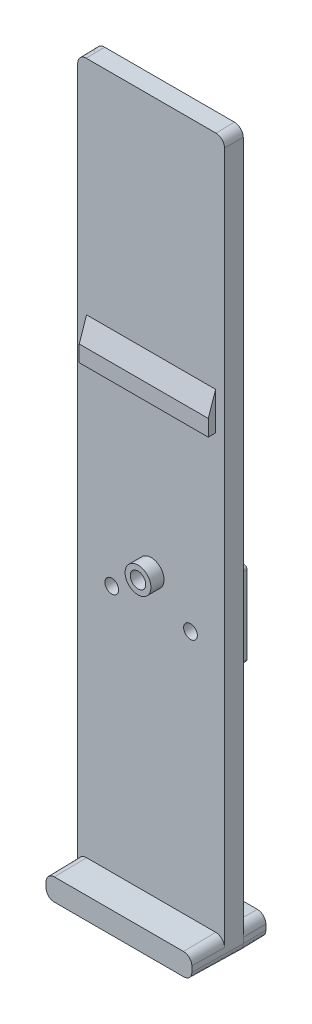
ISO-10303-21;
HEADER;
FILE_DESCRIPTION(('STEP AP214'),'2;1');
FILE_NAME('part.step','',(''),(''),'','','');
FILE_SCHEMA(('AUTOMOTIVE_DESIGN { 1 0 10303 214 1 1 1 1 }'));
ENDSEC;
DATA;
#1=APPLICATION_CONTEXT('core data for automotive mechanical design processes');
#2=APPLICATION_PROTOCOL_DEFINITION('international standard','automotive_design',2000,#1);
#3=PRODUCT_CONTEXT('',#1,'mechanical');
#4=PRODUCT('Part','Part','',(#3));
#5=PRODUCT_RELATED_PRODUCT_CATEGORY('part','',(#4));
#6=PRODUCT_DEFINITION_FORMATION('','',#4);
#7=PRODUCT_DEFINITION_CONTEXT('part definition',#1,'design');
#8=PRODUCT_DEFINITION('design','',#6,#7);
#9=PRODUCT_DEFINITION_SHAPE('','',#8);
#10=(LENGTH_UNIT() NAMED_UNIT(*) SI_UNIT(.MILLI.,.METRE.));
#11=(NAMED_UNIT(*) PLANE_ANGLE_UNIT() SI_UNIT($,.RADIAN.));
#12=(NAMED_UNIT(*) SI_UNIT($,.STERADIAN.) SOLID_ANGLE_UNIT());
#13=UNCERTAINTY_MEASURE_WITH_UNIT(LENGTH_MEASURE(1.E-05),#10,'distance_accuracy_value','');
#14=(GEOMETRIC_REPRESENTATION_CONTEXT(3) GLOBAL_UNCERTAINTY_ASSIGNED_CONTEXT((#13)) GLOBAL_UNIT_ASSIGNED_CONTEXT((#10,
#11,#12)) REPRESENTATION_CONTEXT('',''));
#15=CARTESIAN_POINT('',(0.,0.,0.));
#16=DIRECTION('',(0.,0.,1.));
#17=DIRECTION('',(1.,0.,0.));
#18=AXIS2_PLACEMENT_3D('',#15,#16,#17);
#19=CARTESIAN_POINT('',(-11.176,60.1345,3.175));
#20=DIRECTION('',(0.,0.,-1.));
#21=DIRECTION('',(-1.,0.,0.));
#22=AXIS2_PLACEMENT_3D('',#19,#20,#21);
#23=PLANE('',#22);
#24=CARTESIAN_POINT('',(11.1205801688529,-59.1646801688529,3.175));
#25=DIRECTION('',(0.,0.,1.));
#26=DIRECTION('',(1.,0.,0.));
#27=AXIS2_PLACEMENT_3D('',#24,#25,#26);
#28=CIRCLE('',#27,1.524);
#29=CARTESIAN_POINT('',(12.6445801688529,-59.1646801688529,3.175));
#30=VERTEX_POINT('',#29);
#31=CARTESIAN_POINT('',(11.1205801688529,-57.6406801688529,3.175));
#32=VERTEX_POINT('',#31);
#33=EDGE_CURVE('E1429',#30,#32,#28,.T.);
#34=ORIENTED_EDGE('',*,*,#33,.F.);
#35=DIRECTION('',(0.,-1.,0.));
#36=VECTOR('',#35,1.);
#37=CARTESIAN_POINT('',(12.6445801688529,60.1345,3.175));
#38=LINE('',#37,#36);
#39=CARTESIAN_POINT('',(12.6445801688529,60.1345,3.175));
#40=VERTEX_POINT('',#39);
#41=EDGE_CURVE('E1566',#30,#40,#38,.F.);
#42=ORIENTED_EDGE('',*,*,#41,.T.);
#43=CARTESIAN_POINT('',(11.176,60.1345,3.175));
#44=DIRECTION('',(0.,0.,-1.));
#45=DIRECTION('',(-1.,0.,0.));
#46=AXIS2_PLACEMENT_3D('',#43,#44,#45);
#47=CIRCLE('',#46,1.46858016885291);
#48=CARTESIAN_POINT('',(11.176,61.6030801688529,3.175));
#49=VERTEX_POINT('',#48);
#50=EDGE_CURVE('E1568',#40,#49,#47,.F.);
#51=ORIENTED_EDGE('',*,*,#50,.T.);
#52=DIRECTION('',(1.,0.,0.));
#53=VECTOR('',#52,1.);
#54=CARTESIAN_POINT('',(-11.176,61.6030801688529,3.175));
#55=LINE('',#54,#53);
#56=CARTESIAN_POINT('',(-11.176,61.6030801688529,3.175));
#57=VERTEX_POINT('',#56);
#58=EDGE_CURVE('E1570',#49,#57,#55,.F.);
#59=ORIENTED_EDGE('',*,*,#58,.T.);
#60=CARTESIAN_POINT('',(-11.176,60.1345,3.175));
#61=DIRECTION('',(0.,0.,-1.));
#62=DIRECTION('',(-1.,0.,0.));
#63=AXIS2_PLACEMENT_3D('',#60,#61,#62);
#64=CIRCLE('',#63,1.46858016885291);
#65=CARTESIAN_POINT('',(-12.6445801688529,60.1345,3.175));
#66=VERTEX_POINT('',#65);
#67=EDGE_CURVE('E1560',#57,#66,#64,.F.);
#68=ORIENTED_EDGE('',*,*,#67,.T.);
#69=DIRECTION('',(0.,1.,0.));
#70=VECTOR('',#69,1.);
#71=CARTESIAN_POINT('',(-12.6445801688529,60.1345,3.175));
#72=LINE('',#71,#70);
#73=CARTESIAN_POINT('',(-12.6445801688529,-59.1646801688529,3.175));
#74=VERTEX_POINT('',#73);
#75=EDGE_CURVE('E1563',#66,#74,#72,.F.);
#76=ORIENTED_EDGE('',*,*,#75,.T.);
#77=CARTESIAN_POINT('',(-11.1205801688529,-59.1646801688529,3.175));
#78=DIRECTION('',(0.,0.,1.));
#79=DIRECTION('',(-1.,0.,0.));
#80=AXIS2_PLACEMENT_3D('',#77,#78,#79);
#81=CIRCLE('',#80,1.524);
#82=CARTESIAN_POINT('',(-11.1205801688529,-57.6406801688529,3.175));
#83=VERTEX_POINT('',#82);
#84=EDGE_CURVE('E1460',#83,#74,#81,.T.);
#85=ORIENTED_EDGE('',*,*,#84,.F.);
#86=DIRECTION('',(-1.,0.,0.));
#87=VECTOR('',#86,1.);
#88=CARTESIAN_POINT('',(-11.1205801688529,-57.6406801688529,3.175));
#89=LINE('',#88,#87);
#90=EDGE_CURVE('E1457',#32,#83,#89,.T.);
#91=ORIENTED_EDGE('',*,*,#90,.F.);
#92=EDGE_LOOP('',(#34,#42,#51,#59,#68,#76,#85,#91));
#93=FACE_BOUND('',#92,.T.);
#94=DIRECTION('',(0.,1.,0.));
#95=VECTOR('',#94,1.);
#96=CARTESIAN_POINT('',(11.1125,16.8482801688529,3.175));
#97=LINE('',#96,#95);
#98=CARTESIAN_POINT('',(11.1125,16.8482801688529,3.175));
#99=VERTEX_POINT('',#98);
#100=CARTESIAN_POINT('',(11.1125,23.3506801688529,3.175));
#101=VERTEX_POINT('',#100);
#102=EDGE_CURVE('E1498',#99,#101,#97,.T.);
#103=ORIENTED_EDGE('',*,*,#102,.F.);
#104=DIRECTION('',(-1.,0.,0.));
#105=VECTOR('',#104,1.);
#106=CARTESIAN_POINT('',(11.1125,16.8482801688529,3.175));
#107=LINE('',#106,#105);
#108=CARTESIAN_POINT('',(-11.1125,16.8482801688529,3.175));
#109=VERTEX_POINT('',#108);
#110=EDGE_CURVE('E1398',#99,#109,#107,.T.);
#111=ORIENTED_EDGE('',*,*,#110,.T.);
#112=DIRECTION('',(0.,1.,0.));
#113=VECTOR('',#112,1.);
#114=CARTESIAN_POINT('',(-11.1125,16.8482801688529,3.175));
#115=LINE('',#114,#113);
#116=CARTESIAN_POINT('',(-11.1125,23.3506801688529,3.175));
#117=VERTEX_POINT('',#116);
#118=EDGE_CURVE('E1508',#109,#117,#115,.T.);
#119=ORIENTED_EDGE('',*,*,#118,.T.);
#120=DIRECTION('',(-1.,0.,0.));
#121=VECTOR('',#120,1.);
#122=CARTESIAN_POINT('',(11.1125,23.3506801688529,3.175));
#123=LINE('',#122,#121);
#124=EDGE_CURVE('E1404',#101,#117,#123,.T.);
#125=ORIENTED_EDGE('',*,*,#124,.F.);
#126=EDGE_LOOP('',(#103,#111,#119,#125));
#127=FACE_BOUND('',#126,.T.);
#128=CARTESIAN_POINT('',(6.7818,-14.9479,3.175));
#129=DIRECTION('',(0.,0.,-1.));
#130=DIRECTION('',(-1.,0.,0.));
#131=AXIS2_PLACEMENT_3D('',#128,#129,#130);
#132=CIRCLE('',#131,1.1811);
#133=CARTESIAN_POINT('',(5.6007,-14.9479,3.175));
#134=VERTEX_POINT('',#133);
#135=EDGE_CURVE('E814',#134,#134,#132,.T.);
#136=ORIENTED_EDGE('',*,*,#135,.T.);
#137=EDGE_LOOP('',(#136));
#138=FACE_BOUND('',#137,.T.);
#139=CARTESIAN_POINT('',(-6.7818,-14.9479,3.175));
#140=DIRECTION('',(0.,0.,-1.));
#141=DIRECTION('',(-1.,0.,0.));
#142=AXIS2_PLACEMENT_3D('',#139,#140,#141);
#143=CIRCLE('',#142,1.1811);
#144=CARTESIAN_POINT('',(-7.9629,-14.9479,3.175));
#145=VERTEX_POINT('',#144);
#146=EDGE_CURVE('E822',#145,#145,#143,.T.);
#147=ORIENTED_EDGE('',*,*,#146,.T.);
#148=EDGE_LOOP('',(#147));
#149=FACE_BOUND('',#148,.T.);
#150=CARTESIAN_POINT('',(0.,-9.51610864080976,3.175));
#151=DIRECTION('',(0.,0.,-1.));
#152=DIRECTION('',(-1.,0.,0.));
#153=AXIS2_PLACEMENT_3D('',#150,#151,#152);
#154=CIRCLE('',#153,2.2225);
#155=CARTESIAN_POINT('',(-2.2225,-9.51610864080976,3.175));
#156=VERTEX_POINT('',#155);
#157=EDGE_CURVE('E11',#156,#156,#154,.F.);
#158=ORIENTED_EDGE('',*,*,#157,.F.);
#159=EDGE_LOOP('',(#158));
#160=FACE_BOUND('',#159,.T.);
#161=ADVANCED_FACE('F35',(#93,#127,#138,#149,#160),#23,.F.);
#162=CARTESIAN_POINT('',(6.26109999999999,-55.5371,0.));
#163=DIRECTION('',(-0.999847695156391,0.,0.0174524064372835));
#164=DIRECTION('',(0.0174524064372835,0.,0.999847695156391));
#165=AXIS2_PLACEMENT_3D('',#162,#163,#164);
#166=PLANE('',#165);
#167=DIRECTION('',(0.,1.,0.));
#168=VECTOR('',#167,1.);
#169=CARTESIAN_POINT('',(6.26109999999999,-55.5371,0.));
#170=LINE('',#169,#168);
#171=CARTESIAN_POINT('',(6.26109999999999,-55.5371,0.));
#172=VERTEX_POINT('',#171);
#173=CARTESIAN_POINT('',(6.26109999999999,-21.1201,0.));
#174=VERTEX_POINT('',#173);
#175=EDGE_CURVE('E397',#172,#174,#170,.T.);
#176=ORIENTED_EDGE('',*,*,#175,.T.);
#177=DIRECTION('',(0.0174497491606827,-0.0174497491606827,0.999695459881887));
#178=VECTOR('',#177,1.);
#179=CARTESIAN_POINT('',(6.27157976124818,-21.1305797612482,0.600385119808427));
#180=LINE('',#179,#178);
#181=CARTESIAN_POINT('',(6.27750427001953,-21.1365042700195,0.9398));
#182=VERTEX_POINT('',#181);
#183=EDGE_CURVE('E777',#174,#182,#180,.T.);
#184=ORIENTED_EDGE('',*,*,#183,.T.);
#185=DIRECTION('',(0.,1.,0.));
#186=VECTOR('',#185,1.);
#187=CARTESIAN_POINT('',(6.27750427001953,0.,0.9398));
#188=LINE('',#187,#186);
#189=CARTESIAN_POINT('',(6.27750427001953,-55.5206957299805,0.9398));
#190=VERTEX_POINT('',#189);
#191=EDGE_CURVE('E423',#190,#182,#188,.T.);
#192=ORIENTED_EDGE('',*,*,#191,.F.);
#193=DIRECTION('',(-0.0174497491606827,-0.0174497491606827,-0.999695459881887));
#194=VECTOR('',#193,1.);
#195=CARTESIAN_POINT('',(6.26109999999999,-55.5371,0.));
#196=LINE('',#195,#194);
#197=EDGE_CURVE('E411',#190,#172,#196,.T.);
#198=ORIENTED_EDGE('',*,*,#197,.T.);
#199=EDGE_LOOP('',(#176,#184,#192,#198));
#200=FACE_BOUND('',#199,.T.);
#201=ADVANCED_FACE('F600',(#200),#166,.F.);
#202=CARTESIAN_POINT('',(10.2235,-55.5371,0.));
#203=DIRECTION('',(0.999847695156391,0.,0.0174524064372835));
#204=DIRECTION('',(0.0174524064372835,0.,-0.999847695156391));
#205=AXIS2_PLACEMENT_3D('',#202,#203,#204);
#206=PLANE('',#205);
#207=DIRECTION('',(0.,-1.,0.));
#208=VECTOR('',#207,1.);
#209=CARTESIAN_POINT('',(10.2070957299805,0.,0.9398));
#210=LINE('',#209,#208);
#211=CARTESIAN_POINT('',(10.2070957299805,-20.8387407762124,0.9398));
#212=VERTEX_POINT('',#211);
#213=CARTESIAN_POINT('',(10.2070957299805,-55.5206957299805,0.9398));
#214=VERTEX_POINT('',#213);
#215=EDGE_CURVE('E431',#212,#214,#210,.T.);
#216=ORIENTED_EDGE('',*,*,#215,.F.);
#217=CARTESIAN_POINT('',(9.97581130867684,-20.8597113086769,14.1900756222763));
#218=DIRECTION('',(0.999847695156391,0.,0.0174524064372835));
#219=DIRECTION('',(0.0174497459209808,0.0174603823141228,-0.999695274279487));
#220=AXIS2_PLACEMENT_3D('',#217,#218,#219);
#221=ELLIPSE('',#220,14.5583004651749,0.508);
#222=CARTESIAN_POINT('',(10.2235,-20.7250622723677,0.));
#223=VERTEX_POINT('',#222);
#224=EDGE_CURVE('E740',#212,#223,#221,.T.);
#225=ORIENTED_EDGE('',*,*,#224,.T.);
#226=DIRECTION('',(0.,-1.,0.));
#227=VECTOR('',#226,1.);
#228=CARTESIAN_POINT('',(10.2235,-55.5371,0.));
#229=LINE('',#228,#227);
#230=CARTESIAN_POINT('',(10.2235,-55.5371,0.));
#231=VERTEX_POINT('',#230);
#232=EDGE_CURVE('E404',#223,#231,#229,.T.);
#233=ORIENTED_EDGE('',*,*,#232,.T.);
#234=DIRECTION('',(0.0174497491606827,-0.0174497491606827,-0.999695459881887));
#235=VECTOR('',#234,1.);
#236=CARTESIAN_POINT('',(10.2235,-55.5371,0.));
#237=LINE('',#236,#235);
#238=EDGE_CURVE('E414',#214,#231,#237,.T.);
#239=ORIENTED_EDGE('',*,*,#238,.F.);
#240=EDGE_LOOP('',(#216,#225,#233,#239));
#241=FACE_BOUND('',#240,.T.);
#242=ADVANCED_FACE('F606',(#241),#206,.F.);
#243=CARTESIAN_POINT('',(0.,0.,0.9398));
#244=DIRECTION('',(0.,0.,-1.));
#245=DIRECTION('',(-1.,0.,0.));
#246=AXIS2_PLACEMENT_3D('',#243,#244,#245);
#247=PLANE('',#246);
#248=DIRECTION('',(-1.,0.,0.));
#249=VECTOR('',#248,1.);
#250=CARTESIAN_POINT('',(0.,-21.1365042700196,0.9398));
#251=LINE('',#250,#249);
#252=CARTESIAN_POINT('',(9.74468164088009,-21.1365042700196,0.9398));
#253=VERTEX_POINT('',#252);
#254=EDGE_CURVE('E780',#253,#182,#251,.T.);
#255=ORIENTED_EDGE('',*,*,#254,.F.);
#256=CARTESIAN_POINT('',(9.74452688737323,-20.6284268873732,0.9398));
#257=DIRECTION('',(0.,0.,-1.));
#258=DIRECTION('',(-0.707106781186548,0.707106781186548,0.));
#259=AXIS2_PLACEMENT_3D('',#256,#257,#258);
#260=ELLIPSE('',#259,0.508154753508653,0.508);
#261=EDGE_CURVE('E583',#253,#212,#260,.F.);
#262=ORIENTED_EDGE('',*,*,#261,.T.);
#263=ORIENTED_EDGE('',*,*,#215,.T.);
#264=DIRECTION('',(-1.,0.,0.));
#265=VECTOR('',#264,1.);
#266=CARTESIAN_POINT('',(0.,-55.5206957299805,0.9398));
#267=LINE('',#266,#265);
#268=EDGE_CURVE('E419',#214,#190,#267,.T.);
#269=ORIENTED_EDGE('',*,*,#268,.T.);
#270=ORIENTED_EDGE('',*,*,#191,.T.);
#271=EDGE_LOOP('',(#255,#262,#263,#269,#270));
#272=FACE_BOUND('',#271,.T.);
#273=ADVANCED_FACE('F676',(#272),#247,.T.);
#274=CARTESIAN_POINT('',(-6.26110000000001,-55.5371,0.));
#275=DIRECTION('',(0.999847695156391,0.,0.0174524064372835));
#276=DIRECTION('',(0.0174524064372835,0.,-0.999847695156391));
#277=AXIS2_PLACEMENT_3D('',#274,#275,#276);
#278=PLANE('',#277);
#279=DIRECTION('',(0.,-1.,0.));
#280=VECTOR('',#279,1.);
#281=CARTESIAN_POINT('',(-6.27750427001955,-55.5371,0.9398));
#282=LINE('',#281,#280);
#283=CARTESIAN_POINT('',(-6.27750427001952,-21.1365042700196,0.9398));
#284=VERTEX_POINT('',#283);
#285=CARTESIAN_POINT('',(-6.27750427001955,-55.5206957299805,0.9398));
#286=VERTEX_POINT('',#285);
#287=EDGE_CURVE('E356',#284,#286,#282,.T.);
#288=ORIENTED_EDGE('',*,*,#287,.F.);
#289=DIRECTION('',(0.0174497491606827,0.0174497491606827,-0.999695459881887));
#290=VECTOR('',#289,1.);
#291=CARTESIAN_POINT('',(-6.27157976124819,-21.1305797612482,0.600385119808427));
#292=LINE('',#291,#290);
#293=CARTESIAN_POINT('',(-6.2611,-21.1201,0.));
#294=VERTEX_POINT('',#293);
#295=EDGE_CURVE('E367',#284,#294,#292,.T.);
#296=ORIENTED_EDGE('',*,*,#295,.T.);
#297=DIRECTION('',(0.,-1.,0.));
#298=VECTOR('',#297,1.);
#299=CARTESIAN_POINT('',(-6.26110000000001,-55.5371,0.));
#300=LINE('',#299,#298);
#301=CARTESIAN_POINT('',(-6.26110000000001,-55.5371,0.));
#302=VERTEX_POINT('',#301);
#303=EDGE_CURVE('E782',#294,#302,#300,.T.);
#304=ORIENTED_EDGE('',*,*,#303,.T.);
#305=DIRECTION('',(0.0174497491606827,-0.0174497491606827,-0.999695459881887));
#306=VECTOR('',#305,1.);
#307=CARTESIAN_POINT('',(-6.26110000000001,-55.5371,0.));
#308=LINE('',#307,#306);
#309=EDGE_CURVE('E378',#286,#302,#308,.T.);
#310=ORIENTED_EDGE('',*,*,#309,.F.);
#311=EDGE_LOOP('',(#288,#296,#304,#310));
#312=FACE_BOUND('',#311,.T.);
#313=ADVANCED_FACE('F376',(#312),#278,.F.);
#314=CARTESIAN_POINT('',(-10.2235,-55.5371,0.));
#315=DIRECTION('',(-0.999847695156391,0.,0.0174524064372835));
#316=DIRECTION('',(0.0174524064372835,0.,0.999847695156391));
#317=AXIS2_PLACEMENT_3D('',#314,#315,#316);
#318=PLANE('',#317);
#319=DIRECTION('',(0.,1.,0.));
#320=VECTOR('',#319,1.);
#321=CARTESIAN_POINT('',(-10.2235,-55.5371,0.));
#322=LINE('',#321,#320);
#323=CARTESIAN_POINT('',(-10.2235,-55.5371,0.));
#324=VERTEX_POINT('',#323);
#325=CARTESIAN_POINT('',(-10.2235,-20.7250622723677,0.));
#326=VERTEX_POINT('',#325);
#327=EDGE_CURVE('E385',#324,#326,#322,.T.);
#328=ORIENTED_EDGE('',*,*,#327,.T.);
#329=CARTESIAN_POINT('',(-9.97581130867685,-20.8597113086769,14.1900756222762));
#330=DIRECTION('',(-0.999847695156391,0.,0.0174524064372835));
#331=DIRECTION('',(-0.0174497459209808,0.0174603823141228,-0.999695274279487));
#332=AXIS2_PLACEMENT_3D('',#329,#330,#331);
#333=ELLIPSE('',#332,14.5583004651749,0.508);
#334=CARTESIAN_POINT('',(-10.2070957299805,-20.8387407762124,0.9398));
#335=VERTEX_POINT('',#334);
#336=EDGE_CURVE('E736',#326,#335,#333,.T.);
#337=ORIENTED_EDGE('',*,*,#336,.T.);
#338=DIRECTION('',(0.,1.,0.));
#339=VECTOR('',#338,1.);
#340=CARTESIAN_POINT('',(-10.2070957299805,-55.5371,0.9398));
#341=LINE('',#340,#339);
#342=CARTESIAN_POINT('',(-10.2070957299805,-55.5206957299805,0.9398));
#343=VERTEX_POINT('',#342);
#344=EDGE_CURVE('E394',#343,#335,#341,.T.);
#345=ORIENTED_EDGE('',*,*,#344,.F.);
#346=DIRECTION('',(-0.0174497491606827,-0.0174497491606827,-0.999695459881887));
#347=VECTOR('',#346,1.);
#348=CARTESIAN_POINT('',(-10.2222934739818,-55.5358934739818,0.0691218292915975));
#349=LINE('',#348,#347);
#350=EDGE_CURVE('E791',#343,#324,#349,.T.);
#351=ORIENTED_EDGE('',*,*,#350,.T.);
#352=EDGE_LOOP('',(#328,#337,#345,#351));
#353=FACE_BOUND('',#352,.T.);
#354=ADVANCED_FACE('F668',(#353),#318,.F.);
#355=CARTESIAN_POINT('',(0.,0.,0.9398));
#356=DIRECTION('',(0.,0.,1.));
#357=DIRECTION('',(1.,0.,0.));
#358=AXIS2_PLACEMENT_3D('',#355,#356,#357);
#359=PLANE('',#358);
#360=ORIENTED_EDGE('',*,*,#344,.T.);
#361=CARTESIAN_POINT('',(-9.74452688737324,-20.6284268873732,0.9398));
#362=DIRECTION('',(0.,0.,1.));
#363=DIRECTION('',(0.707106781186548,0.707106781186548,0.));
#364=AXIS2_PLACEMENT_3D('',#361,#362,#363);
#365=ELLIPSE('',#364,0.508154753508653,0.508);
#366=CARTESIAN_POINT('',(-9.7446816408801,-21.1365042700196,0.9398));
#367=VERTEX_POINT('',#366);
#368=EDGE_CURVE('E359',#335,#367,#365,.T.);
#369=ORIENTED_EDGE('',*,*,#368,.T.);
#370=DIRECTION('',(1.,0.,0.));
#371=VECTOR('',#370,1.);
#372=CARTESIAN_POINT('',(0.,-21.1365042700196,0.9398));
#373=LINE('',#372,#371);
#374=EDGE_CURVE('E351',#367,#284,#373,.T.);
#375=ORIENTED_EDGE('',*,*,#374,.T.);
#376=ORIENTED_EDGE('',*,*,#287,.T.);
#377=DIRECTION('',(-1.,0.,0.));
#378=VECTOR('',#377,1.);
#379=CARTESIAN_POINT('',(-6.26110000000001,-55.5206957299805,0.9398));
#380=LINE('',#379,#378);
#381=EDGE_CURVE('E383',#286,#343,#380,.T.);
#382=ORIENTED_EDGE('',*,*,#381,.T.);
#383=EDGE_LOOP('',(#360,#369,#375,#376,#382));
#384=FACE_BOUND('',#383,.T.);
#385=ADVANCED_FACE('F353',(#384),#359,.F.);
#386=CARTESIAN_POINT('',(-11.176,60.1345,0.));
#387=DIRECTION('',(0.,0.,-1.));
#388=DIRECTION('',(-1.,0.,0.));
#389=AXIS2_PLACEMENT_3D('',#386,#387,#388);
#390=CONICAL_SURFACE('',#389,1.524,0.0174532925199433);
#391=CARTESIAN_POINT('',(-11.176,60.1345,0.));
#392=DIRECTION('',(0.,0.,1.));
#393=DIRECTION('',(-1.,0.,0.));
#394=AXIS2_PLACEMENT_3D('',#391,#392,#393);
#395=CIRCLE('',#394,1.524);
#396=CARTESIAN_POINT('',(-11.176,61.6585,0.));
#397=VERTEX_POINT('',#396);
#398=CARTESIAN_POINT('',(-12.7,60.1345,0.));
#399=VERTEX_POINT('',#398);
#400=EDGE_CURVE('E1391',#397,#399,#395,.T.);
#401=ORIENTED_EDGE('',*,*,#400,.T.);
#402=DIRECTION('',(-0.0174524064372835,0.,-0.999847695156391));
#403=VECTOR('',#402,1.);
#404=CARTESIAN_POINT('',(-12.7,60.1345,0.));
#405=LINE('',#404,#403);
#406=EDGE_CURVE('E458',#66,#399,#405,.T.);
#407=ORIENTED_EDGE('',*,*,#406,.F.);
#408=ORIENTED_EDGE('',*,*,#67,.F.);
#409=DIRECTION('',(0.,0.0174524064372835,-0.999847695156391));
#410=VECTOR('',#409,1.);
#411=CARTESIAN_POINT('',(-11.176,61.6585,0.));
#412=LINE('',#411,#410);
#413=EDGE_CURVE('E1395',#57,#397,#412,.T.);
#414=ORIENTED_EDGE('',*,*,#413,.T.);
#415=EDGE_LOOP('',(#401,#407,#408,#414));
#416=FACE_BOUND('',#415,.T.);
#417=ADVANCED_FACE('F622',(#416),#390,.T.);
#418=CARTESIAN_POINT('',(-12.7,-60.1345,0.));
#419=DIRECTION('',(-0.999847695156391,0.,0.0174524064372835));
#420=DIRECTION('',(0.0174524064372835,0.,0.999847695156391));
#421=AXIS2_PLACEMENT_3D('',#418,#419,#420);
#422=PLANE('',#421);
#423=DIRECTION('',(0.,-1.,0.));
#424=VECTOR('',#423,1.);
#425=CARTESIAN_POINT('',(-12.7,-60.1345,0.));
#426=LINE('',#425,#424);
#427=CARTESIAN_POINT('',(-12.7,-59.2201,0.));
#428=VERTEX_POINT('',#427);
#429=EDGE_CURVE('E1397',#399,#428,#426,.T.);
#430=ORIENTED_EDGE('',*,*,#429,.T.);
#431=DIRECTION('',(0.,1.,0.));
#432=VECTOR('',#431,1.);
#433=CARTESIAN_POINT('',(-12.7,-59.2201,0.));
#434=LINE('',#433,#432);
#435=CARTESIAN_POINT('',(-12.7,-60.1345,0.));
#436=VERTEX_POINT('',#435);
#437=EDGE_CURVE('E413',#436,#428,#434,.T.);
#438=ORIENTED_EDGE('',*,*,#437,.F.);
#439=DIRECTION('',(-0.0174524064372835,0.,-0.999847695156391));
#440=VECTOR('',#439,1.);
#441=CARTESIAN_POINT('',(-12.7,-60.1345,0.));
#442=LINE('',#441,#440);
#443=CARTESIAN_POINT('',(-12.5479279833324,-60.1345,8.7122));
#444=VERTEX_POINT('',#443);
#445=EDGE_CURVE('E1534',#444,#436,#442,.T.);
#446=ORIENTED_EDGE('',*,*,#445,.F.);
#447=DIRECTION('',(0.,1.,0.));
#448=VECTOR('',#447,1.);
#449=CARTESIAN_POINT('',(-12.5479279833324,-59.1646801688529,8.7122));
#450=LINE('',#449,#448);
#451=CARTESIAN_POINT('',(-12.5479279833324,-59.1646801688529,8.7122));
#452=VERTEX_POINT('',#451);
#453=EDGE_CURVE('E1468',#452,#444,#450,.F.);
#454=ORIENTED_EDGE('',*,*,#453,.F.);
#455=DIRECTION('',(-0.0174524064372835,0.,-0.999847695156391));
#456=VECTOR('',#455,1.);
#457=CARTESIAN_POINT('',(-12.6445801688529,-59.1646801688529,3.175));
#458=LINE('',#457,#456);
#459=EDGE_CURVE('E1464',#452,#74,#458,.T.);
#460=ORIENTED_EDGE('',*,*,#459,.T.);
#461=ORIENTED_EDGE('',*,*,#75,.F.);
#462=ORIENTED_EDGE('',*,*,#406,.T.);
#463=EDGE_LOOP('',(#430,#438,#446,#454,#460,#461,#462));
#464=FACE_BOUND('',#463,.T.);
#465=ADVANCED_FACE('F558',(#464),#422,.T.);
#466=CARTESIAN_POINT('',(-11.176,-60.1345,0.));
#467=DIRECTION('',(0.,0.,-1.));
#468=DIRECTION('',(-1.,0.,0.));
#469=AXIS2_PLACEMENT_3D('',#466,#467,#468);
#470=CONICAL_SURFACE('',#469,1.524,0.0174532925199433);
#471=CARTESIAN_POINT('',(-11.176,-60.1345,0.));
#472=DIRECTION('',(0.,0.,1.));
#473=DIRECTION('',(-1.,0.,0.));
#474=AXIS2_PLACEMENT_3D('',#471,#472,#473);
#475=CIRCLE('',#474,1.524);
#476=CARTESIAN_POINT('',(-11.176,-61.6585,0.));
#477=VERTEX_POINT('',#476);
#478=EDGE_CURVE('E1401',#436,#477,#475,.T.);
#479=ORIENTED_EDGE('',*,*,#478,.T.);
#480=DIRECTION('',(0.,-0.0174524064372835,-0.999847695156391));
#481=VECTOR('',#480,1.);
#482=CARTESIAN_POINT('',(-11.176,-61.6585,0.));
#483=LINE('',#482,#481);
#484=CARTESIAN_POINT('',(-11.176,-61.5064279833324,8.7122));
#485=VERTEX_POINT('',#484);
#486=EDGE_CURVE('E1536',#485,#477,#483,.T.);
#487=ORIENTED_EDGE('',*,*,#486,.F.);
#488=CARTESIAN_POINT('',(-11.176,-60.1345,8.7122));
#489=DIRECTION('',(0.,0.,1.));
#490=DIRECTION('',(1.,0.,0.));
#491=AXIS2_PLACEMENT_3D('',#488,#489,#490);
#492=CIRCLE('',#491,1.37192798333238);
#493=EDGE_CURVE('E1463',#444,#485,#492,.T.);
#494=ORIENTED_EDGE('',*,*,#493,.F.);
#495=ORIENTED_EDGE('',*,*,#445,.T.);
#496=EDGE_LOOP('',(#479,#487,#494,#495));
#497=FACE_BOUND('',#496,.T.);
#498=ADVANCED_FACE('F1140',(#497),#470,.T.);
#499=CARTESIAN_POINT('',(-11.176,-61.6585,0.));
#500=DIRECTION('',(0.,-0.999847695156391,0.0174524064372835));
#501=DIRECTION('',(0.,-0.0174524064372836,-0.999847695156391));
#502=AXIS2_PLACEMENT_3D('',#499,#500,#501);
#503=PLANE('',#502);
#504=DIRECTION('',(1.,0.,0.));
#505=VECTOR('',#504,1.);
#506=CARTESIAN_POINT('',(-11.176,-61.6585,0.));
#507=LINE('',#506,#505);
#508=CARTESIAN_POINT('',(11.176,-61.6585,0.));
#509=VERTEX_POINT('',#508);
#510=EDGE_CURVE('E1599',#477,#509,#507,.T.);
#511=ORIENTED_EDGE('',*,*,#510,.T.);
#512=DIRECTION('',(0.,-0.0174524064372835,-0.999847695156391));
#513=VECTOR('',#512,1.);
#514=CARTESIAN_POINT('',(11.176,-61.6585,0.));
#515=LINE('',#514,#513);
#516=CARTESIAN_POINT('',(11.176,-61.5064279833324,8.7122));
#517=VERTEX_POINT('',#516);
#518=EDGE_CURVE('E1540',#517,#509,#515,.T.);
#519=ORIENTED_EDGE('',*,*,#518,.F.);
#520=DIRECTION('',(-1.,0.,0.));
#521=VECTOR('',#520,1.);
#522=CARTESIAN_POINT('',(-11.176,-61.5064279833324,8.7122));
#523=LINE('',#522,#521);
#524=EDGE_CURVE('E1480',#485,#517,#523,.F.);
#525=ORIENTED_EDGE('',*,*,#524,.F.);
#526=ORIENTED_EDGE('',*,*,#486,.T.);
#527=EDGE_LOOP('',(#511,#519,#525,#526));
#528=FACE_BOUND('',#527,.T.);
#529=ADVANCED_FACE('F1132',(#528),#503,.T.);
#530=CARTESIAN_POINT('',(11.176,-60.1345,0.));
#531=DIRECTION('',(0.,0.,-1.));
#532=DIRECTION('',(1.,0.,0.));
#533=AXIS2_PLACEMENT_3D('',#530,#531,#532);
#534=CONICAL_SURFACE('',#533,1.524,0.0174532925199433);
#535=CARTESIAN_POINT('',(11.176,-60.1345,0.));
#536=DIRECTION('',(0.,0.,1.));
#537=DIRECTION('',(1.,0.,0.));
#538=AXIS2_PLACEMENT_3D('',#535,#536,#537);
#539=CIRCLE('',#538,1.524);
#540=CARTESIAN_POINT('',(12.7,-60.1345,0.));
#541=VERTEX_POINT('',#540);
#542=EDGE_CURVE('E1548',#509,#541,#539,.T.);
#543=ORIENTED_EDGE('',*,*,#542,.T.);
#544=DIRECTION('',(0.0174524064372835,0.,-0.999847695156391));
#545=VECTOR('',#544,1.);
#546=CARTESIAN_POINT('',(12.7,-60.1345,0.));
#547=LINE('',#546,#545);
#548=CARTESIAN_POINT('',(12.5479279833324,-60.1345,8.7122));
#549=VERTEX_POINT('',#548);
#550=EDGE_CURVE('E1547',#549,#541,#547,.T.);
#551=ORIENTED_EDGE('',*,*,#550,.F.);
#552=CARTESIAN_POINT('',(11.176,-60.1345,8.7122));
#553=DIRECTION('',(0.,0.,1.));
#554=DIRECTION('',(1.,0.,0.));
#555=AXIS2_PLACEMENT_3D('',#552,#553,#554);
#556=CIRCLE('',#555,1.37192798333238);
#557=EDGE_CURVE('E1483',#517,#549,#556,.T.);
#558=ORIENTED_EDGE('',*,*,#557,.F.);
#559=ORIENTED_EDGE('',*,*,#518,.T.);
#560=EDGE_LOOP('',(#543,#551,#558,#559));
#561=FACE_BOUND('',#560,.T.);
#562=ADVANCED_FACE('F1124',(#561),#534,.T.);
#563=CARTESIAN_POINT('',(12.7,-60.1345,0.));
#564=DIRECTION('',(0.999847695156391,0.,0.0174524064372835));
#565=DIRECTION('',(0.0174524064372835,0.,-0.999847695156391));
#566=AXIS2_PLACEMENT_3D('',#563,#564,#565);
#567=PLANE('',#566);
#568=DIRECTION('',(0.,1.,0.));
#569=VECTOR('',#568,1.);
#570=CARTESIAN_POINT('',(12.7,-60.1345,0.));
#571=LINE('',#570,#569);
#572=CARTESIAN_POINT('',(12.7,-59.2201,0.));
#573=VERTEX_POINT('',#572);
#574=EDGE_CURVE('E1413',#541,#573,#571,.T.);
#575=ORIENTED_EDGE('',*,*,#574,.T.);
#576=CARTESIAN_POINT('',(12.7,60.1345,0.));
#577=VERTEX_POINT('',#576);
#578=EDGE_CURVE('E1571',#573,#577,#571,.T.);
#579=ORIENTED_EDGE('',*,*,#578,.T.);
#580=DIRECTION('',(0.0174524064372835,0.,-0.999847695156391));
#581=VECTOR('',#580,1.);
#582=CARTESIAN_POINT('',(12.7,60.1345,0.));
#583=LINE('',#582,#581);
#584=EDGE_CURVE('E1551',#40,#577,#583,.T.);
#585=ORIENTED_EDGE('',*,*,#584,.F.);
#586=ORIENTED_EDGE('',*,*,#41,.F.);
#587=DIRECTION('',(0.0174524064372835,0.,-0.999847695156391));
#588=VECTOR('',#587,1.);
#589=CARTESIAN_POINT('',(12.6445801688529,-59.1646801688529,3.175));
#590=LINE('',#589,#588);
#591=CARTESIAN_POINT('',(12.5479279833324,-59.1646801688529,8.7122));
#592=VERTEX_POINT('',#591);
#593=EDGE_CURVE('E1474',#592,#30,#590,.T.);
#594=ORIENTED_EDGE('',*,*,#593,.F.);
#595=DIRECTION('',(0.,-1.,0.));
#596=VECTOR('',#595,1.);
#597=CARTESIAN_POINT('',(12.5479279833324,-60.1345,8.7122));
#598=LINE('',#597,#596);
#599=EDGE_CURVE('E1486',#549,#592,#598,.F.);
#600=ORIENTED_EDGE('',*,*,#599,.F.);
#601=ORIENTED_EDGE('',*,*,#550,.T.);
#602=EDGE_LOOP('',(#575,#579,#585,#586,#594,#600,#601));
#603=FACE_BOUND('',#602,.T.);
#604=ADVANCED_FACE('F1116',(#603),#567,.T.);
#605=CARTESIAN_POINT('',(11.176,60.1345,0.));
#606=DIRECTION('',(0.,0.,-1.));
#607=DIRECTION('',(-1.,0.,0.));
#608=AXIS2_PLACEMENT_3D('',#605,#606,#607);
#609=CONICAL_SURFACE('',#608,1.524,0.0174532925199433);
#610=CARTESIAN_POINT('',(11.176,60.1345,0.));
#611=DIRECTION('',(0.,0.,1.));
#612=DIRECTION('',(-1.,0.,0.));
#613=AXIS2_PLACEMENT_3D('',#610,#611,#612);
#614=CIRCLE('',#613,1.524);
#615=CARTESIAN_POINT('',(11.176,61.6585,0.));
#616=VERTEX_POINT('',#615);
#617=EDGE_CURVE('E1575',#577,#616,#614,.T.);
#618=ORIENTED_EDGE('',*,*,#617,.T.);
#619=DIRECTION('',(0.,0.0174524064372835,-0.999847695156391));
#620=VECTOR('',#619,1.);
#621=CARTESIAN_POINT('',(11.176,61.6585,0.));
#622=LINE('',#621,#620);
#623=EDGE_CURVE('E1555',#49,#616,#622,.T.);
#624=ORIENTED_EDGE('',*,*,#623,.F.);
#625=ORIENTED_EDGE('',*,*,#50,.F.);
#626=ORIENTED_EDGE('',*,*,#584,.T.);
#627=EDGE_LOOP('',(#618,#624,#625,#626));
#628=FACE_BOUND('',#627,.T.);
#629=ADVANCED_FACE('F1109',(#628),#609,.T.);
#630=CARTESIAN_POINT('',(-11.176,61.6585,0.));
#631=DIRECTION('',(0.,0.999847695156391,0.0174524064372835));
#632=DIRECTION('',(0.,-0.0174524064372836,0.999847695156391));
#633=AXIS2_PLACEMENT_3D('',#630,#631,#632);
#634=PLANE('',#633);
#635=DIRECTION('',(-1.,0.,0.));
#636=VECTOR('',#635,1.);
#637=CARTESIAN_POINT('',(-11.176,61.6585,0.));
#638=LINE('',#637,#636);
#639=EDGE_CURVE('E1564',#616,#397,#638,.T.);
#640=ORIENTED_EDGE('',*,*,#639,.T.);
#641=ORIENTED_EDGE('',*,*,#413,.F.);
#642=ORIENTED_EDGE('',*,*,#58,.F.);
#643=ORIENTED_EDGE('',*,*,#623,.T.);
#644=EDGE_LOOP('',(#640,#641,#642,#643));
#645=FACE_BOUND('',#644,.T.);
#646=ADVANCED_FACE('F620',(#645),#634,.T.);
#647=CARTESIAN_POINT('',(-11.176,60.1345,0.));
#648=DIRECTION('',(0.,0.,-1.));
#649=DIRECTION('',(-1.,0.,0.));
#650=AXIS2_PLACEMENT_3D('',#647,#648,#649);
#651=PLANE('',#650);
#652=CARTESIAN_POINT('',(0.,-9.51610864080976,0.));
#653=DIRECTION('',(0.,0.,-1.));
#654=DIRECTION('',(-1.,0.,0.));
#655=AXIS2_PLACEMENT_3D('',#652,#653,#654);
#656=CIRCLE('',#655,1.3335);
#657=CARTESIAN_POINT('',(-1.3335,-9.51610864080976,0.));
#658=VERTEX_POINT('',#657);
#659=EDGE_CURVE('E831',#658,#658,#656,.T.);
#660=ORIENTED_EDGE('',*,*,#659,.F.);
#661=EDGE_LOOP('',(#660));
#662=FACE_BOUND('',#661,.T.);
#663=DIRECTION('',(-1.,0.,0.));
#664=VECTOR('',#663,1.);
#665=CARTESIAN_POINT('',(-11.176,-21.1201,0.));
#666=LINE('',#665,#664);
#667=EDGE_CURVE('E371',#174,#294,#666,.T.);
#668=ORIENTED_EDGE('',*,*,#667,.F.);
#669=ORIENTED_EDGE('',*,*,#175,.F.);
#670=DIRECTION('',(-1.,0.,0.));
#671=VECTOR('',#670,1.);
#672=CARTESIAN_POINT('',(6.26109999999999,-55.5371,0.));
#673=LINE('',#672,#671);
#674=EDGE_CURVE('E407',#231,#172,#673,.T.);
#675=ORIENTED_EDGE('',*,*,#674,.F.);
#676=ORIENTED_EDGE('',*,*,#232,.F.);
#677=CARTESIAN_POINT('',(9.72812261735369,-20.6120226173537,0.));
#678=DIRECTION('',(0.,0.,-1.));
#679=DIRECTION('',(-0.707106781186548,0.707106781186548,0.));
#680=AXIS2_PLACEMENT_3D('',#677,#678,#679);
#681=ELLIPSE('',#680,0.508154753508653,0.508);
#682=CARTESIAN_POINT('',(10.2362,-20.6121773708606,0.));
#683=VERTEX_POINT('',#682);
#684=EDGE_CURVE('E737',#223,#683,#681,.F.);
#685=ORIENTED_EDGE('',*,*,#684,.T.);
#686=DIRECTION('',(0.,-1.,0.));
#687=VECTOR('',#686,1.);
#688=CARTESIAN_POINT('',(10.2362,60.1345,0.));
#689=LINE('',#688,#687);
#690=CARTESIAN_POINT('',(10.2362,-7.12462262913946,0.));
#691=VERTEX_POINT('',#690);
#692=EDGE_CURVE('E468',#691,#683,#689,.T.);
#693=ORIENTED_EDGE('',*,*,#692,.F.);
#694=CARTESIAN_POINT('',(9.72812261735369,-7.12477738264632,0.));
#695=DIRECTION('',(0.,0.,-1.));
#696=DIRECTION('',(-0.707106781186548,-0.707106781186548,0.));
#697=AXIS2_PLACEMENT_3D('',#694,#695,#696);
#698=ELLIPSE('',#697,0.508154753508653,0.508);
#699=CARTESIAN_POINT('',(10.2235,-7.01173772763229,0.));
#700=VERTEX_POINT('',#699);
#701=EDGE_CURVE('E744',#691,#700,#698,.F.);
#702=ORIENTED_EDGE('',*,*,#701,.T.);
#703=CARTESIAN_POINT('',(10.2235,59.2201,0.));
#704=VERTEX_POINT('',#703);
#705=EDGE_CURVE('E405',#704,#700,#229,.T.);
#706=ORIENTED_EDGE('',*,*,#705,.F.);
#707=DIRECTION('',(1.,0.,0.));
#708=VECTOR('',#707,1.);
#709=CARTESIAN_POINT('',(6.26109999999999,59.2201,0.));
#710=LINE('',#709,#708);
#711=CARTESIAN_POINT('',(6.26109999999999,59.2201,0.));
#712=VERTEX_POINT('',#711);
#713=EDGE_CURVE('E400',#712,#704,#710,.T.);
#714=ORIENTED_EDGE('',*,*,#713,.F.);
#715=CARTESIAN_POINT('',(6.26109999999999,-6.81968165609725,0.));
#716=VERTEX_POINT('',#715);
#717=EDGE_CURVE('E401',#716,#712,#170,.T.);
#718=ORIENTED_EDGE('',*,*,#717,.F.);
#719=CARTESIAN_POINT('',(6.46084990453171,-6.41459388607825,11.5786515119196));
#720=CARTESIAN_POINT('',(5.93385904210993,-6.4147604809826,11.5691072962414));
#721=CARTESIAN_POINT('',(5.95327817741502,-6.94139345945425,11.5786515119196));
#722=CARTESIAN_POINT('',(6.50057258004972,-6.4528672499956,9.3859719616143));
#723=CARTESIAN_POINT('',(5.97668437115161,-6.45291094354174,9.38346876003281));
#724=CARTESIAN_POINT('',(5.9928849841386,-6.97654834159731,9.3859719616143));
#725=CARTESIAN_POINT('',(6.53993015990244,-6.49114072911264,7.19328581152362));
#726=CARTESIAN_POINT('',(6.01919865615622,-6.49118757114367,7.19060223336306));
#727=CARTESIAN_POINT('',(6.03215730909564,-7.01175858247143,7.19328581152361));
#728=CARTESIAN_POINT('',(6.61795131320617,-6.56768789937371,2.80790136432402));
#729=CARTESIAN_POINT('',(6.10335369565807,-6.56773127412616,2.80541642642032));
#730=CARTESIAN_POINT('',(6.1100635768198,-7.08228436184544,2.80790136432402));
#731=CARTESIAN_POINT('',(6.65661488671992,-6.60596159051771,0.615203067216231));
#732=CARTESIAN_POINT('',(6.1450108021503,-6.60600851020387,0.612515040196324));
#733=CARTESIAN_POINT('',(6.14869751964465,-7.11759990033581,0.615203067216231));
#734=CARTESIAN_POINT('',(6.73328421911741,-6.68250917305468,-3.77020499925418));
#735=CARTESIAN_POINT('',(6.22750141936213,-6.68255319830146,-3.77272720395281));
#736=CARTESIAN_POINT('',(6.22535761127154,-7.18833086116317,-3.77020499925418));
#737=CARTESIAN_POINT('',(6.77128997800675,-6.72078306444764,-5.9629147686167));
#738=CARTESIAN_POINT('',(6.26834969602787,-6.720830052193,-5.96560669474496));
#739=CARTESIAN_POINT('',(6.26338376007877,-7.22374628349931,-5.9629147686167));
#740=CARTESIAN_POINT('',(6.84667549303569,-6.79733103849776,-10.3483452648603));
#741=CARTESIAN_POINT('',(6.34926941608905,-6.79737555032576,-10.3508953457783));
#742=CARTESIAN_POINT('',(6.33885533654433,-7.2946721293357,-10.3483452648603));
#743=CARTESIAN_POINT('',(6.88405524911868,-6.83560512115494,-12.5410659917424));
#744=CARTESIAN_POINT('',(6.38935425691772,-6.83565293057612,-12.5438049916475));
#745=CARTESIAN_POINT('',(6.37630076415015,-7.33018255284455,-12.5410659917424));
#746=CARTESIAN_POINT('',(6.92113790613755,-6.8738792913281,-14.7337917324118));
#747=CARTESIAN_POINT('',(6.42917364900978,-6.87402447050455,-14.7421090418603));
#748=CARTESIAN_POINT('',(6.41346936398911,-7.3657380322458,-14.7337917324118));
#749=(BOUNDED_SURFACE() B_SPLINE_SURFACE(3,2,((#719,#720,#721),(#722,#723,#724),(#725,#726,
#727),(#728,#729,#730),(#731,#732,#733),(#734,#735,#736),(#737,#738,#739),(#740,#741,#742),
(#743,#744,#745),(#746,#747,#748)),.UNSPECIFIED.,.F.,.F.,.F.) B_SPLINE_SURFACE_WITH_KNOTS((4,2,
2,2,4),(3,3),(0.,6.58011979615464,13.1602389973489,19.7403581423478,26.3204778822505),(0.,1.),
.UNSPECIFIED.) GEOMETRIC_REPRESENTATION_ITEM() RATIONAL_B_SPLINE_SURFACE(((1.,0.693956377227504,
1.),(1.,0.696167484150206,1.),(1.,0.69832896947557,1.),(1.,0.702558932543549,1.),(1.,
0.704627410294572,1.),(1.,0.708677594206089,1.),(1.,0.710659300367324,1.),(1.,0.714541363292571,
1.),(1.,0.716441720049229,1.),(1.,0.718304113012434,1.))) REPRESENTATION_ITEM('') SURFACE());
#750=CARTESIAN_POINT('',(6.26109999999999,-6.81968165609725,0.));
#751=CARTESIAN_POINT('',(6.24370161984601,-6.84281825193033,0.));
#752=CARTESIAN_POINT('',(6.22832468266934,-6.8674658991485,0.));
#753=CARTESIAN_POINT('',(6.20231695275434,-6.91832252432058,0.));
#754=CARTESIAN_POINT('',(6.19157078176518,-6.94447252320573,0.));
#755=CARTESIAN_POINT('',(6.1751907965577,-6.99622048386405,0.));
#756=CARTESIAN_POINT('',(6.16924032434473,-7.02171872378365,0.));
#757=CARTESIAN_POINT('',(6.16120908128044,-7.07397929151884,0.));
#758=CARTESIAN_POINT('',(6.15923009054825,-7.10075727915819,0.));
#759=CARTESIAN_POINT('',(6.15939902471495,-7.12753097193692,0.));
#760=B_SPLINE_CURVE_WITH_KNOTS('',3,(#750,#751,#752,#753,#754,#755,#756,#757,#758,#759),
.UNSPECIFIED.,.F.,.F.,(4,2,2,2,4),(0.,0.0867306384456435,0.171154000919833,0.249397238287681,
0.329621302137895),.UNSPECIFIED.);
#761=CARTESIAN_POINT('',(6.15939902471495,-7.12753097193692,0.));
#762=VERTEX_POINT('',#761);
#763=EDGE_CURVE('E626',#716,#762,#760,.T.);
#764=ORIENTED_EDGE('',*,*,#763,.T.);
#765=CARTESIAN_POINT('',(0.,-7.16280000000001,0.));
#766=DIRECTION('',(0.,0.,-1.));
#767=DIRECTION('',(-1.,0.,0.));
#768=AXIS2_PLACEMENT_3D('',#765,#766,#767);
#769=CIRCLE('',#768,6.1595);
#770=CARTESIAN_POINT('',(-6.15939902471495,-7.12753097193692,0.));
#771=VERTEX_POINT('',#770);
#772=EDGE_CURVE('E462',#771,#762,#769,.F.);
#773=ORIENTED_EDGE('',*,*,#772,.F.);
#774=CARTESIAN_POINT('',(-5.95327817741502,-6.94139345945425,11.5786515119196));
#775=CARTESIAN_POINT('',(-5.93385904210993,-6.4147604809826,11.5691072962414));
#776=CARTESIAN_POINT('',(-6.46084990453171,-6.41459388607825,11.5786515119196));
#777=CARTESIAN_POINT('',(-5.9928849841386,-6.97654834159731,9.3859719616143));
#778=CARTESIAN_POINT('',(-5.97668437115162,-6.45291094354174,9.38346876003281));
#779=CARTESIAN_POINT('',(-6.50057258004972,-6.4528672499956,9.3859719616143));
#780=CARTESIAN_POINT('',(-6.03215730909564,-7.01175858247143,7.19328581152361));
#781=CARTESIAN_POINT('',(-6.01919865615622,-6.49118757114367,7.19060223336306));
#782=CARTESIAN_POINT('',(-6.53993015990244,-6.49114072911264,7.19328581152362));
#783=CARTESIAN_POINT('',(-6.1100635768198,-7.08228436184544,2.80790136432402));
#784=CARTESIAN_POINT('',(-6.10335369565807,-6.56773127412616,2.80541642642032));
#785=CARTESIAN_POINT('',(-6.61795131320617,-6.56768789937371,2.80790136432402));
#786=CARTESIAN_POINT('',(-6.14869751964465,-7.11759990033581,0.615203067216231));
#787=CARTESIAN_POINT('',(-6.1450108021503,-6.60600851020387,0.612515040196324));
#788=CARTESIAN_POINT('',(-6.65661488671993,-6.60596159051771,0.615203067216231));
#789=CARTESIAN_POINT('',(-6.22535761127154,-7.18833086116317,-3.77020499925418));
#790=CARTESIAN_POINT('',(-6.22750141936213,-6.68255319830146,-3.77272720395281));
#791=CARTESIAN_POINT('',(-6.73328421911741,-6.68250917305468,-3.77020499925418));
#792=CARTESIAN_POINT('',(-6.26338376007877,-7.22374628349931,-5.9629147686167));
#793=CARTESIAN_POINT('',(-6.26834969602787,-6.720830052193,-5.96560669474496));
#794=CARTESIAN_POINT('',(-6.77128997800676,-6.72078306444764,-5.9629147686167));
#795=CARTESIAN_POINT('',(-6.33885533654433,-7.2946721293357,-10.3483452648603));
#796=CARTESIAN_POINT('',(-6.34926941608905,-6.79737555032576,-10.3508953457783));
#797=CARTESIAN_POINT('',(-6.84667549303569,-6.79733103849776,-10.3483452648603));
#798=CARTESIAN_POINT('',(-6.37630076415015,-7.33018255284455,-12.5410659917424));
#799=CARTESIAN_POINT('',(-6.38935425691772,-6.83565293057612,-12.5438049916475));
#800=CARTESIAN_POINT('',(-6.88405524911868,-6.83560512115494,-12.5410659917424));
#801=CARTESIAN_POINT('',(-6.41346936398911,-7.3657380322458,-14.7337917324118));
#802=CARTESIAN_POINT('',(-6.42917364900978,-6.87402447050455,-14.7421090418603));
#803=CARTESIAN_POINT('',(-6.92113790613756,-6.8738792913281,-14.7337917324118));
#804=(BOUNDED_SURFACE() B_SPLINE_SURFACE(3,2,((#774,#775,#776),(#777,#778,#779),(#780,#781,
#782),(#783,#784,#785),(#786,#787,#788),(#789,#790,#791),(#792,#793,#794),(#795,#796,#797),
(#798,#799,#800),(#801,#802,#803)),.UNSPECIFIED.,.F.,.F.,.F.) B_SPLINE_SURFACE_WITH_KNOTS((4,2,
2,2,4),(3,3),(0.,6.58011979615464,13.1602389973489,19.7403581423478,26.3204778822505),(0.,1.),
.UNSPECIFIED.) GEOMETRIC_REPRESENTATION_ITEM() RATIONAL_B_SPLINE_SURFACE(((1.,0.693956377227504,
1.),(1.,0.696167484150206,1.),(1.,0.69832896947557,1.),(1.,0.702558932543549,1.),(1.,
0.704627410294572,1.),(1.,0.708677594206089,1.),(1.,0.710659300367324,1.),(1.,0.714541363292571,
1.),(1.,0.716441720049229,1.),(1.,0.718304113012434,1.))) REPRESENTATION_ITEM('') SURFACE());
#805=CARTESIAN_POINT('',(-6.15939902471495,-7.12753097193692,0.));
#806=CARTESIAN_POINT('',(-6.1592086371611,-7.09858076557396,0.));
#807=CARTESIAN_POINT('',(-6.16154132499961,-7.06962096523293,0.));
#808=CARTESIAN_POINT('',(-6.1709486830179,-7.01327478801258,0.));
#809=CARTESIAN_POINT('',(-6.17789553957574,-6.98586704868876,0.));
#810=CARTESIAN_POINT('',(-6.19556590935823,-6.93454539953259,0.));
#811=CARTESIAN_POINT('',(-6.2059749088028,-6.9105226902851,0.));
#812=CARTESIAN_POINT('',(-6.23065417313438,-6.86376741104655,0.));
#813=CARTESIAN_POINT('',(-6.24501551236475,-6.84108289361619,0.));
#814=CARTESIAN_POINT('',(-6.2611,-6.81968165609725,0.));
#815=B_SPLINE_CURVE_WITH_KNOTS('',3,(#805,#806,#807,#808,#809,#810,#811,#812,#813,#814),
.UNSPECIFIED.,.F.,.F.,(4,2,2,2,4),(0.,0.086738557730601,0.171169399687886,0.249405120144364,
0.329621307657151),.UNSPECIFIED.);
#816=CARTESIAN_POINT('',(-6.26109999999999,-6.81968165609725,0.));
#817=VERTEX_POINT('',#816);
#818=EDGE_CURVE('E632',#771,#817,#815,.T.);
#819=ORIENTED_EDGE('',*,*,#818,.T.);
#820=CARTESIAN_POINT('',(-6.26109999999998,59.2201,0.));
#821=VERTEX_POINT('',#820);
#822=EDGE_CURVE('E783',#821,#817,#300,.T.);
#823=ORIENTED_EDGE('',*,*,#822,.F.);
#824=DIRECTION('',(1.,0.,0.));
#825=VECTOR('',#824,1.);
#826=CARTESIAN_POINT('',(-6.26109999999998,59.2201,0.));
#827=LINE('',#826,#825);
#828=CARTESIAN_POINT('',(-10.2235,59.2201,0.));
#829=VERTEX_POINT('',#828);
#830=EDGE_CURVE('E381',#829,#821,#827,.T.);
#831=ORIENTED_EDGE('',*,*,#830,.F.);
#832=CARTESIAN_POINT('',(-10.2235,-7.01173772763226,0.));
#833=VERTEX_POINT('',#832);
#834=EDGE_CURVE('E50',#833,#829,#322,.T.);
#835=ORIENTED_EDGE('',*,*,#834,.F.);
#836=CARTESIAN_POINT('',(-9.7281226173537,-7.12477738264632,0.));
#837=DIRECTION('',(0.,0.,-1.));
#838=DIRECTION('',(0.707106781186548,-0.707106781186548,0.));
#839=AXIS2_PLACEMENT_3D('',#836,#837,#838);
#840=ELLIPSE('',#839,0.508154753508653,0.508);
#841=CARTESIAN_POINT('',(-10.2362,-7.12462262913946,0.));
#842=VERTEX_POINT('',#841);
#843=EDGE_CURVE('E43',#833,#842,#840,.F.);
#844=ORIENTED_EDGE('',*,*,#843,.T.);
#845=DIRECTION('',(0.,1.,0.));
#846=VECTOR('',#845,1.);
#847=CARTESIAN_POINT('',(-10.2362,60.1345,0.));
#848=LINE('',#847,#846);
#849=CARTESIAN_POINT('',(-10.2362,-20.6121773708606,0.));
#850=VERTEX_POINT('',#849);
#851=EDGE_CURVE('E465',#850,#842,#848,.T.);
#852=ORIENTED_EDGE('',*,*,#851,.F.);
#853=CARTESIAN_POINT('',(-9.7281226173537,-20.6120226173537,0.));
#854=DIRECTION('',(0.,0.,-1.));
#855=DIRECTION('',(0.707106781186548,0.707106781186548,0.));
#856=AXIS2_PLACEMENT_3D('',#853,#854,#855);
#857=ELLIPSE('',#856,0.508154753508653,0.508);
#858=EDGE_CURVE('E732',#850,#326,#857,.F.);
#859=ORIENTED_EDGE('',*,*,#858,.T.);
#860=ORIENTED_EDGE('',*,*,#327,.F.);
#861=DIRECTION('',(-1.,0.,0.));
#862=VECTOR('',#861,1.);
#863=CARTESIAN_POINT('',(-6.26110000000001,-55.5371,0.));
#864=LINE('',#863,#862);
#865=EDGE_CURVE('E785',#302,#324,#864,.T.);
#866=ORIENTED_EDGE('',*,*,#865,.F.);
#867=ORIENTED_EDGE('',*,*,#303,.F.);
#868=EDGE_LOOP('',(#668,#669,#675,#676,#685,#693,#702,#706,#714,#718,#764,#773,#819,#823,#831,
#835,#844,#852,#859,#860,#866,#867));
#869=FACE_BOUND('',#868,.T.);
#870=CARTESIAN_POINT('',(11.176,-59.2201,0.));
#871=DIRECTION('',(0.,0.,-1.));
#872=DIRECTION('',(-1.,0.,0.));
#873=AXIS2_PLACEMENT_3D('',#870,#871,#872);
#874=CIRCLE('',#873,1.524);
#875=CARTESIAN_POINT('',(11.176,-57.6961,0.));
#876=VERTEX_POINT('',#875);
#877=EDGE_CURVE('E437',#876,#573,#874,.T.);
#878=ORIENTED_EDGE('',*,*,#877,.F.);
#879=DIRECTION('',(1.,0.,0.));
#880=VECTOR('',#879,1.);
#881=CARTESIAN_POINT('',(11.176,-57.6961,0.));
#882=LINE('',#881,#880);
#883=CARTESIAN_POINT('',(-11.176,-57.6961,0.));
#884=VERTEX_POINT('',#883);
#885=EDGE_CURVE('E434',#884,#876,#882,.T.);
#886=ORIENTED_EDGE('',*,*,#885,.F.);
#887=CARTESIAN_POINT('',(-11.176,-59.2201,0.));
#888=DIRECTION('',(0.,0.,-1.));
#889=DIRECTION('',(-1.,0.,0.));
#890=AXIS2_PLACEMENT_3D('',#887,#888,#889);
#891=CIRCLE('',#890,1.524);
#892=EDGE_CURVE('E438',#428,#884,#891,.T.);
#893=ORIENTED_EDGE('',*,*,#892,.F.);
#894=ORIENTED_EDGE('',*,*,#429,.F.);
#895=ORIENTED_EDGE('',*,*,#400,.F.);
#896=ORIENTED_EDGE('',*,*,#639,.F.);
#897=ORIENTED_EDGE('',*,*,#617,.F.);
#898=ORIENTED_EDGE('',*,*,#578,.F.);
#899=EDGE_LOOP('',(#878,#886,#893,#894,#895,#896,#897,#898));
#900=FACE_BOUND('',#899,.T.);
#901=ADVANCED_FACE('F616',(#662,#869,#900),#651,.T.);
#902=CARTESIAN_POINT('',(11.1125,16.8482801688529,3.175));
#903=DIRECTION('',(0.,1.,0.));
#904=DIRECTION('',(0.,0.,1.));
#905=AXIS2_PLACEMENT_3D('',#902,#903,#904);
#906=PLANE('',#905);
#907=DIRECTION('',(0.,0.,-1.));
#908=VECTOR('',#907,1.);
#909=CARTESIAN_POINT('',(-11.1125,16.8482801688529,3.175));
#910=LINE('',#909,#908);
#911=CARTESIAN_POINT('',(-11.1125,16.8482801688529,4.445));
#912=VERTEX_POINT('',#911);
#913=EDGE_CURVE('E1477',#912,#109,#910,.T.);
#914=ORIENTED_EDGE('',*,*,#913,.T.);
#915=ORIENTED_EDGE('',*,*,#110,.F.);
#916=DIRECTION('',(0.,0.,-1.));
#917=VECTOR('',#916,1.);
#918=CARTESIAN_POINT('',(11.1125,16.8482801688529,3.175));
#919=LINE('',#918,#917);
#920=CARTESIAN_POINT('',(11.1125,16.8482801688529,4.445));
#921=VERTEX_POINT('',#920);
#922=EDGE_CURVE('E1496',#921,#99,#919,.T.);
#923=ORIENTED_EDGE('',*,*,#922,.F.);
#924=DIRECTION('',(-1.,0.,0.));
#925=VECTOR('',#924,1.);
#926=CARTESIAN_POINT('',(11.1125,16.8482801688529,4.445));
#927=LINE('',#926,#925);
#928=EDGE_CURVE('E1505',#921,#912,#927,.T.);
#929=ORIENTED_EDGE('',*,*,#928,.T.);
#930=EDGE_LOOP('',(#914,#915,#923,#929));
#931=FACE_BOUND('',#930,.T.);
#932=ADVANCED_FACE('F614',(#931),#906,.F.);
#933=CARTESIAN_POINT('',(11.1125,19.6422801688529,4.445));
#934=DIRECTION('',(0.,-0.32399297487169,-0.946059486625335));
#935=DIRECTION('',(0.,0.946059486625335,-0.32399297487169));
#936=AXIS2_PLACEMENT_3D('',#933,#934,#935);
#937=PLANE('',#936);
#938=DIRECTION('',(0.,-0.946059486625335,0.32399297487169));
#939=VECTOR('',#938,1.);
#940=CARTESIAN_POINT('',(-11.1125,19.6422801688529,4.445));
#941=LINE('',#940,#939);
#942=CARTESIAN_POINT('',(-11.1125,19.6422801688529,4.445));
#943=VERTEX_POINT('',#942);
#944=EDGE_CURVE('E1511',#117,#943,#941,.T.);
#945=ORIENTED_EDGE('',*,*,#944,.T.);
#946=DIRECTION('',(-1.,0.,0.));
#947=VECTOR('',#946,1.);
#948=CARTESIAN_POINT('',(11.1125,19.6422801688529,4.445));
#949=LINE('',#948,#947);
#950=CARTESIAN_POINT('',(11.1125,19.6422801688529,4.445));
#951=VERTEX_POINT('',#950);
#952=EDGE_CURVE('E1516',#951,#943,#949,.T.);
#953=ORIENTED_EDGE('',*,*,#952,.F.);
#954=DIRECTION('',(0.,-0.946059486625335,0.32399297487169));
#955=VECTOR('',#954,1.);
#956=CARTESIAN_POINT('',(11.1125,19.6422801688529,4.445));
#957=LINE('',#956,#955);
#958=EDGE_CURVE('E1501',#101,#951,#957,.T.);
#959=ORIENTED_EDGE('',*,*,#958,.F.);
#960=ORIENTED_EDGE('',*,*,#124,.T.);
#961=EDGE_LOOP('',(#945,#953,#959,#960));
#962=FACE_BOUND('',#961,.T.);
#963=ADVANCED_FACE('F1084',(#962),#937,.F.);
#964=CARTESIAN_POINT('',(11.1125,16.8482801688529,4.445));
#965=DIRECTION('',(0.,0.,-1.));
#966=DIRECTION('',(-1.,0.,0.));
#967=AXIS2_PLACEMENT_3D('',#964,#965,#966);
#968=PLANE('',#967);
#969=DIRECTION('',(0.,-1.,0.));
#970=VECTOR('',#969,1.);
#971=CARTESIAN_POINT('',(-11.1125,16.8482801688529,4.445));
#972=LINE('',#971,#970);
#973=EDGE_CURVE('E1499',#943,#912,#972,.T.);
#974=ORIENTED_EDGE('',*,*,#973,.T.);
#975=ORIENTED_EDGE('',*,*,#928,.F.);
#976=DIRECTION('',(0.,-1.,0.));
#977=VECTOR('',#976,1.);
#978=CARTESIAN_POINT('',(11.1125,16.8482801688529,4.445));
#979=LINE('',#978,#977);
#980=EDGE_CURVE('E1503',#951,#921,#979,.T.);
#981=ORIENTED_EDGE('',*,*,#980,.F.);
#982=ORIENTED_EDGE('',*,*,#952,.T.);
#983=EDGE_LOOP('',(#974,#975,#981,#982));
#984=FACE_BOUND('',#983,.T.);
#985=ADVANCED_FACE('F1076',(#984),#968,.F.);
#986=CARTESIAN_POINT('',(11.1125,0.,0.));
#987=DIRECTION('',(-1.,0.,0.));
#988=DIRECTION('',(0.,0.,1.));
#989=AXIS2_PLACEMENT_3D('',#986,#987,#988);
#990=PLANE('',#989);
#991=ORIENTED_EDGE('',*,*,#922,.T.);
#992=ORIENTED_EDGE('',*,*,#102,.T.);
#993=ORIENTED_EDGE('',*,*,#958,.T.);
#994=ORIENTED_EDGE('',*,*,#980,.T.);
#995=EDGE_LOOP('',(#991,#992,#993,#994));
#996=FACE_BOUND('',#995,.T.);
#997=ADVANCED_FACE('F1068',(#996),#990,.F.);
#998=CARTESIAN_POINT('',(-11.1125,0.,0.));
#999=DIRECTION('',(-1.,0.,0.));
#1000=DIRECTION('',(0.,0.,1.));
#1001=AXIS2_PLACEMENT_3D('',#998,#999,#1000);
#1002=PLANE('',#1001);
#1003=ORIENTED_EDGE('',*,*,#913,.F.);
#1004=ORIENTED_EDGE('',*,*,#973,.F.);
#1005=ORIENTED_EDGE('',*,*,#944,.F.);
#1006=ORIENTED_EDGE('',*,*,#118,.F.);
#1007=EDGE_LOOP('',(#1003,#1004,#1005,#1006));
#1008=FACE_BOUND('',#1007,.T.);
#1009=ADVANCED_FACE('F1060',(#1008),#1002,.T.);
#1010=CARTESIAN_POINT('',(11.1205801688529,-59.1646801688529,3.175));
#1011=DIRECTION('',(0.,0.,-1.));
#1012=DIRECTION('',(1.,0.,0.));
#1013=AXIS2_PLACEMENT_3D('',#1010,#1011,#1012);
#1014=CONICAL_SURFACE('',#1013,1.524,0.0174532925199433);
#1015=ORIENTED_EDGE('',*,*,#33,.T.);
#1016=DIRECTION('',(0.,0.0174524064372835,-0.999847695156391));
#1017=VECTOR('',#1016,1.);
#1018=CARTESIAN_POINT('',(11.1205801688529,-57.6406801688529,3.175));
#1019=LINE('',#1018,#1017);
#1020=CARTESIAN_POINT('',(11.1205801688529,-57.7373323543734,8.7122));
#1021=VERTEX_POINT('',#1020);
#1022=EDGE_CURVE('E1471',#1021,#32,#1019,.T.);
#1023=ORIENTED_EDGE('',*,*,#1022,.F.);
#1024=CARTESIAN_POINT('',(11.1205801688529,-59.1646801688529,8.7122));
#1025=DIRECTION('',(0.,0.,1.));
#1026=DIRECTION('',(1.,0.,0.));
#1027=AXIS2_PLACEMENT_3D('',#1024,#1025,#1026);
#1028=CIRCLE('',#1027,1.42734781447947);
#1029=EDGE_CURVE('E1488',#592,#1021,#1028,.T.);
#1030=ORIENTED_EDGE('',*,*,#1029,.F.);
#1031=ORIENTED_EDGE('',*,*,#593,.T.);
#1032=EDGE_LOOP('',(#1015,#1023,#1030,#1031));
#1033=FACE_BOUND('',#1032,.T.);
#1034=ADVANCED_FACE('F1052',(#1033),#1014,.T.);
#1035=CARTESIAN_POINT('',(-11.1205801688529,-57.6406801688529,3.175));
#1036=DIRECTION('',(0.,0.999847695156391,0.0174524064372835));
#1037=DIRECTION('',(0.,-0.0174524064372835,0.999847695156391));
#1038=AXIS2_PLACEMENT_3D('',#1035,#1036,#1037);
#1039=PLANE('',#1038);
#1040=ORIENTED_EDGE('',*,*,#90,.T.);
#1041=DIRECTION('',(0.,0.0174524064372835,-0.999847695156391));
#1042=VECTOR('',#1041,1.);
#1043=CARTESIAN_POINT('',(-11.1205801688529,-57.6406801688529,3.175));
#1044=LINE('',#1043,#1042);
#1045=CARTESIAN_POINT('',(-11.1205801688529,-57.7373323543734,8.7122));
#1046=VERTEX_POINT('',#1045);
#1047=EDGE_CURVE('E1467',#1046,#83,#1044,.T.);
#1048=ORIENTED_EDGE('',*,*,#1047,.F.);
#1049=DIRECTION('',(1.,0.,0.));
#1050=VECTOR('',#1049,1.);
#1051=CARTESIAN_POINT('',(-11.1205801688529,-57.7373323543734,8.7122));
#1052=LINE('',#1051,#1050);
#1053=EDGE_CURVE('E1490',#1021,#1046,#1052,.F.);
#1054=ORIENTED_EDGE('',*,*,#1053,.F.);
#1055=ORIENTED_EDGE('',*,*,#1022,.T.);
#1056=EDGE_LOOP('',(#1040,#1048,#1054,#1055));
#1057=FACE_BOUND('',#1056,.T.);
#1058=ADVANCED_FACE('F1044',(#1057),#1039,.T.);
#1059=CARTESIAN_POINT('',(-11.1205801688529,-59.1646801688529,3.175));
#1060=DIRECTION('',(0.,0.,-1.));
#1061=DIRECTION('',(-1.,0.,0.));
#1062=AXIS2_PLACEMENT_3D('',#1059,#1060,#1061);
#1063=CONICAL_SURFACE('',#1062,1.524,0.0174532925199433);
#1064=ORIENTED_EDGE('',*,*,#84,.T.);
#1065=ORIENTED_EDGE('',*,*,#459,.F.);
#1066=CARTESIAN_POINT('',(-11.1205801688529,-59.1646801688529,8.7122));
#1067=DIRECTION('',(0.,0.,1.));
#1068=DIRECTION('',(1.,0.,0.));
#1069=AXIS2_PLACEMENT_3D('',#1066,#1067,#1068);
#1070=CIRCLE('',#1069,1.42734781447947);
#1071=EDGE_CURVE('E1492',#1046,#452,#1070,.T.);
#1072=ORIENTED_EDGE('',*,*,#1071,.F.);
#1073=ORIENTED_EDGE('',*,*,#1047,.T.);
#1074=EDGE_LOOP('',(#1064,#1065,#1072,#1073));
#1075=FACE_BOUND('',#1074,.T.);
#1076=ADVANCED_FACE('F1035',(#1075),#1063,.T.);
#1077=CARTESIAN_POINT('',(-11.176,-60.1345,8.7122));
#1078=DIRECTION('',(0.,0.,1.));
#1079=DIRECTION('',(1.,0.,0.));
#1080=AXIS2_PLACEMENT_3D('',#1077,#1078,#1079);
#1081=PLANE('',#1080);
#1082=ORIENTED_EDGE('',*,*,#493,.T.);
#1083=ORIENTED_EDGE('',*,*,#524,.T.);
#1084=ORIENTED_EDGE('',*,*,#557,.T.);
#1085=ORIENTED_EDGE('',*,*,#599,.T.);
#1086=ORIENTED_EDGE('',*,*,#1029,.T.);
#1087=ORIENTED_EDGE('',*,*,#1053,.T.);
#1088=ORIENTED_EDGE('',*,*,#1071,.T.);
#1089=ORIENTED_EDGE('',*,*,#453,.T.);
#1090=EDGE_LOOP('',(#1082,#1083,#1084,#1085,#1086,#1087,#1088,#1089));
#1091=FACE_BOUND('',#1090,.T.);
#1092=ADVANCED_FACE('F1026',(#1091),#1081,.T.);
#1093=CARTESIAN_POINT('',(-11.176,-60.1345,0.));
#1094=DIRECTION('',(0.,0.,1.));
#1095=DIRECTION('',(-1.,0.,0.));
#1096=AXIS2_PLACEMENT_3D('',#1093,#1094,#1095);
#1097=CONICAL_SURFACE('',#1096,1.524,0.0174532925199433);
#1098=ORIENTED_EDGE('',*,*,#478,.F.);
#1099=DIRECTION('',(-0.0174524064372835,0.,0.999847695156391));
#1100=VECTOR('',#1099,1.);
#1101=CARTESIAN_POINT('',(-12.7,-60.1345,0.));
#1102=LINE('',#1101,#1100);
#1103=CARTESIAN_POINT('',(-12.6308360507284,-60.1345,-3.9624));
#1104=VERTEX_POINT('',#1103);
#1105=EDGE_CURVE('E441',#1104,#436,#1102,.T.);
#1106=ORIENTED_EDGE('',*,*,#1105,.F.);
#1107=CARTESIAN_POINT('',(-11.176,-60.1345,-3.9624));
#1108=DIRECTION('',(0.,0.,-1.));
#1109=DIRECTION('',(-1.,0.,0.));
#1110=AXIS2_PLACEMENT_3D('',#1107,#1108,#1109);
#1111=CIRCLE('',#1110,1.45483605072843);
#1112=CARTESIAN_POINT('',(-11.176,-61.5893360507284,-3.9624));
#1113=VERTEX_POINT('',#1112);
#1114=EDGE_CURVE('E447',#1113,#1104,#1111,.T.);
#1115=ORIENTED_EDGE('',*,*,#1114,.F.);
#1116=DIRECTION('',(0.,-0.0174524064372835,0.999847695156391));
#1117=VECTOR('',#1116,1.);
#1118=CARTESIAN_POINT('',(-11.176,-61.6585,0.));
#1119=LINE('',#1118,#1117);
#1120=EDGE_CURVE('E1454',#1113,#477,#1119,.T.);
#1121=ORIENTED_EDGE('',*,*,#1120,.T.);
#1122=EDGE_LOOP('',(#1098,#1106,#1115,#1121));
#1123=FACE_BOUND('',#1122,.T.);
#1124=ADVANCED_FACE('F1018',(#1123),#1097,.T.);
#1125=CARTESIAN_POINT('',(-12.7,-59.2201,0.));
#1126=DIRECTION('',(-0.999847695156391,0.,-0.0174524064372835));
#1127=DIRECTION('',(-0.0174524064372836,0.,0.999847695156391));
#1128=AXIS2_PLACEMENT_3D('',#1125,#1126,#1127);
#1129=PLANE('',#1128);
#1130=ORIENTED_EDGE('',*,*,#437,.T.);
#1131=DIRECTION('',(-0.0174524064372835,0.,0.999847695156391));
#1132=VECTOR('',#1131,1.);
#1133=CARTESIAN_POINT('',(-12.7,-59.2201,0.));
#1134=LINE('',#1133,#1132);
#1135=CARTESIAN_POINT('',(-12.6308360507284,-59.2201,-3.9624));
#1136=VERTEX_POINT('',#1135);
#1137=EDGE_CURVE('E1423',#1136,#428,#1134,.T.);
#1138=ORIENTED_EDGE('',*,*,#1137,.F.);
#1139=DIRECTION('',(0.,-1.,0.));
#1140=VECTOR('',#1139,1.);
#1141=CARTESIAN_POINT('',(-12.6308360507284,-59.2201,-3.9624));
#1142=LINE('',#1141,#1140);
#1143=EDGE_CURVE('E1440',#1104,#1136,#1142,.F.);
#1144=ORIENTED_EDGE('',*,*,#1143,.F.);
#1145=ORIENTED_EDGE('',*,*,#1105,.T.);
#1146=EDGE_LOOP('',(#1130,#1138,#1144,#1145));
#1147=FACE_BOUND('',#1146,.T.);
#1148=ADVANCED_FACE('F1010',(#1147),#1129,.T.);
#1149=CARTESIAN_POINT('',(-11.176,-59.2201,0.));
#1150=DIRECTION('',(0.,0.,1.));
#1151=DIRECTION('',(-1.,0.,0.));
#1152=AXIS2_PLACEMENT_3D('',#1149,#1150,#1151);
#1153=CONICAL_SURFACE('',#1152,1.524,0.0174532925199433);
#1154=ORIENTED_EDGE('',*,*,#892,.T.);
#1155=DIRECTION('',(0.,0.0174524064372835,0.999847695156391));
#1156=VECTOR('',#1155,1.);
#1157=CARTESIAN_POINT('',(-11.176,-57.6961,0.));
#1158=LINE('',#1157,#1156);
#1159=CARTESIAN_POINT('',(-11.176,-57.7652639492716,-3.9624));
#1160=VERTEX_POINT('',#1159);
#1161=EDGE_CURVE('E1425',#1160,#884,#1158,.T.);
#1162=ORIENTED_EDGE('',*,*,#1161,.F.);
#1163=CARTESIAN_POINT('',(-11.176,-59.2201,-3.9624));
#1164=DIRECTION('',(0.,0.,-1.));
#1165=DIRECTION('',(-1.,0.,0.));
#1166=AXIS2_PLACEMENT_3D('',#1163,#1164,#1165);
#1167=CIRCLE('',#1166,1.45483605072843);
#1168=EDGE_CURVE('E1442',#1136,#1160,#1167,.T.);
#1169=ORIENTED_EDGE('',*,*,#1168,.F.);
#1170=ORIENTED_EDGE('',*,*,#1137,.T.);
#1171=EDGE_LOOP('',(#1154,#1162,#1169,#1170));
#1172=FACE_BOUND('',#1171,.T.);
#1173=ADVANCED_FACE('F1002',(#1172),#1153,.T.);
#1174=CARTESIAN_POINT('',(11.176,-57.6961,0.));
#1175=DIRECTION('',(0.,0.999847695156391,-0.0174524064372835));
#1176=DIRECTION('',(0.,0.0174524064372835,0.999847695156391));
#1177=AXIS2_PLACEMENT_3D('',#1174,#1175,#1176);
#1178=PLANE('',#1177);
#1179=ORIENTED_EDGE('',*,*,#885,.T.);
#1180=DIRECTION('',(0.,0.0174524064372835,0.999847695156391));
#1181=VECTOR('',#1180,1.);
#1182=CARTESIAN_POINT('',(11.176,-57.6961,0.));
#1183=LINE('',#1182,#1181);
#1184=CARTESIAN_POINT('',(11.176,-57.7652639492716,-3.9624));
#1185=VERTEX_POINT('',#1184);
#1186=EDGE_CURVE('E453',#1185,#876,#1183,.T.);
#1187=ORIENTED_EDGE('',*,*,#1186,.F.);
#1188=DIRECTION('',(-1.,0.,0.));
#1189=VECTOR('',#1188,1.);
#1190=CARTESIAN_POINT('',(11.176,-57.7652639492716,-3.9624));
#1191=LINE('',#1190,#1189);
#1192=EDGE_CURVE('E1444',#1160,#1185,#1191,.F.);
#1193=ORIENTED_EDGE('',*,*,#1192,.F.);
#1194=ORIENTED_EDGE('',*,*,#1161,.T.);
#1195=EDGE_LOOP('',(#1179,#1187,#1193,#1194));
#1196=FACE_BOUND('',#1195,.T.);
#1197=ADVANCED_FACE('F994',(#1196),#1178,.T.);
#1198=CARTESIAN_POINT('',(11.176,-59.2201,0.));
#1199=DIRECTION('',(0.,0.,1.));
#1200=DIRECTION('',(-1.,0.,0.));
#1201=AXIS2_PLACEMENT_3D('',#1198,#1199,#1200);
#1202=CONICAL_SURFACE('',#1201,1.524,0.0174532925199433);
#1203=ORIENTED_EDGE('',*,*,#877,.T.);
#1204=DIRECTION('',(0.0174524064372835,0.,0.999847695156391));
#1205=VECTOR('',#1204,1.);
#1206=CARTESIAN_POINT('',(12.7,-59.2201,0.));
#1207=LINE('',#1206,#1205);
#1208=CARTESIAN_POINT('',(12.6308360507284,-59.2201,-3.9624));
#1209=VERTEX_POINT('',#1208);
#1210=EDGE_CURVE('E450',#1209,#573,#1207,.T.);
#1211=ORIENTED_EDGE('',*,*,#1210,.F.);
#1212=CARTESIAN_POINT('',(11.176,-59.2201,-3.9624));
#1213=DIRECTION('',(0.,0.,-1.));
#1214=DIRECTION('',(-1.,0.,0.));
#1215=AXIS2_PLACEMENT_3D('',#1212,#1213,#1214);
#1216=CIRCLE('',#1215,1.45483605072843);
#1217=EDGE_CURVE('E1446',#1185,#1209,#1216,.T.);
#1218=ORIENTED_EDGE('',*,*,#1217,.F.);
#1219=ORIENTED_EDGE('',*,*,#1186,.T.);
#1220=EDGE_LOOP('',(#1203,#1211,#1218,#1219));
#1221=FACE_BOUND('',#1220,.T.);
#1222=ADVANCED_FACE('F986',(#1221),#1202,.T.);
#1223=CARTESIAN_POINT('',(12.7,-60.1345,0.));
#1224=DIRECTION('',(0.999847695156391,0.,-0.0174524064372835));
#1225=DIRECTION('',(-0.0174524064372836,0.,-0.999847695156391));
#1226=AXIS2_PLACEMENT_3D('',#1223,#1224,#1225);
#1227=PLANE('',#1226);
#1228=ORIENTED_EDGE('',*,*,#574,.F.);
#1229=DIRECTION('',(0.0174524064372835,0.,0.999847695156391));
#1230=VECTOR('',#1229,1.);
#1231=CARTESIAN_POINT('',(12.7,-60.1345,0.));
#1232=LINE('',#1231,#1230);
#1233=CARTESIAN_POINT('',(12.6308360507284,-60.1345,-3.9624));
#1234=VERTEX_POINT('',#1233);
#1235=EDGE_CURVE('E454',#1234,#541,#1232,.T.);
#1236=ORIENTED_EDGE('',*,*,#1235,.F.);
#1237=DIRECTION('',(0.,1.,0.));
#1238=VECTOR('',#1237,1.);
#1239=CARTESIAN_POINT('',(12.6308360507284,-60.1345,-3.9624));
#1240=LINE('',#1239,#1238);
#1241=EDGE_CURVE('E1448',#1209,#1234,#1240,.F.);
#1242=ORIENTED_EDGE('',*,*,#1241,.F.);
#1243=ORIENTED_EDGE('',*,*,#1210,.T.);
#1244=EDGE_LOOP('',(#1228,#1236,#1242,#1243));
#1245=FACE_BOUND('',#1244,.T.);
#1246=ADVANCED_FACE('F978',(#1245),#1227,.T.);
#1247=CARTESIAN_POINT('',(11.176,-60.1345,0.));
#1248=DIRECTION('',(0.,0.,1.));
#1249=DIRECTION('',(-1.,0.,0.));
#1250=AXIS2_PLACEMENT_3D('',#1247,#1248,#1249);
#1251=CONICAL_SURFACE('',#1250,1.524,0.0174532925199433);
#1252=ORIENTED_EDGE('',*,*,#542,.F.);
#1253=DIRECTION('',(0.,-0.0174524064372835,0.999847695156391));
#1254=VECTOR('',#1253,1.);
#1255=CARTESIAN_POINT('',(11.176,-61.6585,0.));
#1256=LINE('',#1255,#1254);
#1257=CARTESIAN_POINT('',(11.176,-61.5893360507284,-3.9624));
#1258=VERTEX_POINT('',#1257);
#1259=EDGE_CURVE('E1602',#1258,#509,#1256,.T.);
#1260=ORIENTED_EDGE('',*,*,#1259,.F.);
#1261=CARTESIAN_POINT('',(11.176,-60.1345,-3.9624));
#1262=DIRECTION('',(0.,0.,-1.));
#1263=DIRECTION('',(-1.,0.,0.));
#1264=AXIS2_PLACEMENT_3D('',#1261,#1262,#1263);
#1265=CIRCLE('',#1264,1.45483605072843);
#1266=EDGE_CURVE('E1450',#1234,#1258,#1265,.T.);
#1267=ORIENTED_EDGE('',*,*,#1266,.F.);
#1268=ORIENTED_EDGE('',*,*,#1235,.T.);
#1269=EDGE_LOOP('',(#1252,#1260,#1267,#1268));
#1270=FACE_BOUND('',#1269,.T.);
#1271=ADVANCED_FACE('F970',(#1270),#1251,.T.);
#1272=CARTESIAN_POINT('',(-11.176,-61.6585,0.));
#1273=DIRECTION('',(0.,-0.999847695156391,-0.0174524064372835));
#1274=DIRECTION('',(0.,0.0174524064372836,-0.999847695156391));
#1275=AXIS2_PLACEMENT_3D('',#1272,#1273,#1274);
#1276=PLANE('',#1275);
#1277=ORIENTED_EDGE('',*,*,#510,.F.);
#1278=ORIENTED_EDGE('',*,*,#1120,.F.);
#1279=DIRECTION('',(1.,0.,0.));
#1280=VECTOR('',#1279,1.);
#1281=CARTESIAN_POINT('',(-11.176,-61.5893360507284,-3.9624));
#1282=LINE('',#1281,#1280);
#1283=EDGE_CURVE('E1452',#1258,#1113,#1282,.F.);
#1284=ORIENTED_EDGE('',*,*,#1283,.F.);
#1285=ORIENTED_EDGE('',*,*,#1259,.T.);
#1286=EDGE_LOOP('',(#1277,#1278,#1284,#1285));
#1287=FACE_BOUND('',#1286,.T.);
#1288=ADVANCED_FACE('F962',(#1287),#1276,.T.);
#1289=CARTESIAN_POINT('',(-11.176,-60.1345,-3.9624));
#1290=DIRECTION('',(0.,0.,-1.));
#1291=DIRECTION('',(-1.,0.,0.));
#1292=AXIS2_PLACEMENT_3D('',#1289,#1290,#1291);
#1293=PLANE('',#1292);
#1294=ORIENTED_EDGE('',*,*,#1114,.T.);
#1295=ORIENTED_EDGE('',*,*,#1143,.T.);
#1296=ORIENTED_EDGE('',*,*,#1168,.T.);
#1297=ORIENTED_EDGE('',*,*,#1192,.T.);
#1298=ORIENTED_EDGE('',*,*,#1217,.T.);
#1299=ORIENTED_EDGE('',*,*,#1241,.T.);
#1300=ORIENTED_EDGE('',*,*,#1266,.T.);
#1301=ORIENTED_EDGE('',*,*,#1283,.T.);
#1302=EDGE_LOOP('',(#1294,#1295,#1296,#1297,#1298,#1299,#1300,#1301));
#1303=FACE_BOUND('',#1302,.T.);
#1304=ADVANCED_FACE('F956',(#1303),#1293,.T.);
#1305=CARTESIAN_POINT('',(6.27750427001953,-6.76375691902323,0.9398));
#1306=VERTEX_POINT('',#1305);
#1307=CARTESIAN_POINT('',(6.27750427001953,59.2036957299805,0.9398));
#1308=VERTEX_POINT('',#1307);
#1309=EDGE_CURVE('E410',#1306,#1308,#188,.T.);
#1310=ORIENTED_EDGE('',*,*,#1309,.F.);
#1311=CARTESIAN_POINT('',(6.27750427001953,-6.76375691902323,0.9398));
#1312=CARTESIAN_POINT('',(6.27476952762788,-6.77240610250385,0.783126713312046));
#1313=CARTESIAN_POINT('',(6.27203513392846,-6.7813910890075,0.626473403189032));
#1314=CARTESIAN_POINT('',(6.26656704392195,-6.8000326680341,0.31320673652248));
#1315=CARTESIAN_POINT('',(6.26383334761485,-6.80968926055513,0.156593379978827));
#1316=CARTESIAN_POINT('',(6.26109999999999,-6.81968165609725,0.));
#1317=B_SPLINE_CURVE_WITH_KNOTS('',3,(#1311,#1312,#1313,#1314,#1315,#1316),.UNSPECIFIED.,.F.,
.F.,(4,2,4),(0.,0.470803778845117,0.941607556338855),.UNSPECIFIED.);
#1318=EDGE_CURVE('E686',#1306,#716,#1317,.T.);
#1319=ORIENTED_EDGE('',*,*,#1318,.T.);
#1320=ORIENTED_EDGE('',*,*,#717,.T.);
#1321=DIRECTION('',(-0.0174497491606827,0.0174497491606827,-0.999695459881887));
#1322=VECTOR('',#1321,1.);
#1323=CARTESIAN_POINT('',(6.29604284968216,59.1851571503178,2.0018745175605));
#1324=LINE('',#1323,#1322);
#1325=EDGE_CURVE('E415',#1308,#712,#1324,.T.);
#1326=ORIENTED_EDGE('',*,*,#1325,.F.);
#1327=EDGE_LOOP('',(#1310,#1319,#1320,#1326));
#1328=FACE_BOUND('',#1327,.T.);
#1329=ADVANCED_FACE('F609',(#1328),#166,.F.);
#1330=CARTESIAN_POINT('',(6.26109999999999,-55.5371,0.));
#1331=DIRECTION('',(0.,-0.999847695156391,0.0174524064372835));
#1332=DIRECTION('',(0.,-0.0174524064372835,-0.999847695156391));
#1333=AXIS2_PLACEMENT_3D('',#1330,#1331,#1332);
#1334=PLANE('',#1333);
#1335=ORIENTED_EDGE('',*,*,#674,.T.);
#1336=ORIENTED_EDGE('',*,*,#197,.F.);
#1337=ORIENTED_EDGE('',*,*,#268,.F.);
#1338=ORIENTED_EDGE('',*,*,#238,.T.);
#1339=EDGE_LOOP('',(#1335,#1336,#1337,#1338));
#1340=FACE_BOUND('',#1339,.T.);
#1341=ADVANCED_FACE('F942',(#1340),#1334,.F.);
#1342=ORIENTED_EDGE('',*,*,#705,.T.);
#1343=CARTESIAN_POINT('',(9.97581130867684,-6.87708869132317,14.1900756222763));
#1344=DIRECTION('',(0.999847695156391,0.,0.0174524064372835));
#1345=DIRECTION('',(0.0174497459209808,-0.0174603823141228,-0.999695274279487));
#1346=AXIS2_PLACEMENT_3D('',#1343,#1344,#1345);
#1347=ELLIPSE('',#1346,14.5583004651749,0.508);
#1348=CARTESIAN_POINT('',(10.2070957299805,-6.89805922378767,0.9398));
#1349=VERTEX_POINT('',#1348);
#1350=EDGE_CURVE('E746',#700,#1349,#1347,.T.);
#1351=ORIENTED_EDGE('',*,*,#1350,.T.);
#1352=CARTESIAN_POINT('',(10.2070957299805,59.2036957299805,0.9398));
#1353=VERTEX_POINT('',#1352);
#1354=EDGE_CURVE('E429',#1353,#1349,#210,.T.);
#1355=ORIENTED_EDGE('',*,*,#1354,.F.);
#1356=DIRECTION('',(0.0174497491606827,0.0174497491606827,-0.999695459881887));
#1357=VECTOR('',#1356,1.);
#1358=CARTESIAN_POINT('',(10.2222934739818,59.2188934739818,0.0691218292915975));
#1359=LINE('',#1358,#1357);
#1360=EDGE_CURVE('E418',#1353,#704,#1359,.T.);
#1361=ORIENTED_EDGE('',*,*,#1360,.T.);
#1362=EDGE_LOOP('',(#1342,#1351,#1355,#1361));
#1363=FACE_BOUND('',#1362,.T.);
#1364=ADVANCED_FACE('F935',(#1363),#206,.F.);
#1365=CARTESIAN_POINT('',(6.26109999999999,59.2201,0.));
#1366=DIRECTION('',(0.,0.999847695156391,0.0174524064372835));
#1367=DIRECTION('',(0.,-0.0174524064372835,0.999847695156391));
#1368=AXIS2_PLACEMENT_3D('',#1365,#1366,#1367);
#1369=PLANE('',#1368);
#1370=ORIENTED_EDGE('',*,*,#713,.T.);
#1371=ORIENTED_EDGE('',*,*,#1360,.F.);
#1372=DIRECTION('',(1.,0.,0.));
#1373=VECTOR('',#1372,1.);
#1374=CARTESIAN_POINT('',(0.,59.2036957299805,0.9398));
#1375=LINE('',#1374,#1373);
#1376=EDGE_CURVE('E426',#1308,#1353,#1375,.T.);
#1377=ORIENTED_EDGE('',*,*,#1376,.F.);
#1378=ORIENTED_EDGE('',*,*,#1325,.T.);
#1379=EDGE_LOOP('',(#1370,#1371,#1377,#1378));
#1380=FACE_BOUND('',#1379,.T.);
#1381=ADVANCED_FACE('F674',(#1380),#1369,.F.);
#1382=DIRECTION('',(1.,0.,0.));
#1383=VECTOR('',#1382,1.);
#1384=CARTESIAN_POINT('',(0.,-6.60029572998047,0.9398));
#1385=LINE('',#1384,#1383);
#1386=CARTESIAN_POINT('',(6.65079439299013,-6.60029572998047,0.9398));
#1387=VERTEX_POINT('',#1386);
#1388=CARTESIAN_POINT('',(9.74468164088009,-6.60029572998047,0.9398));
#1389=VERTEX_POINT('',#1388);
#1390=EDGE_CURVE('E363',#1387,#1389,#1385,.T.);
#1391=ORIENTED_EDGE('',*,*,#1390,.F.);
#1392=CARTESIAN_POINT('',(6.65079439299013,-6.60029572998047,0.9398));
#1393=CARTESIAN_POINT('',(6.62223229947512,-6.60027054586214,0.9398));
#1394=CARTESIAN_POINT('',(6.59367576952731,-6.60270245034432,0.9398));
#1395=CARTESIAN_POINT('',(6.53736338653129,-6.612304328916,0.9398));
#1396=CARTESIAN_POINT('',(6.50960770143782,-6.61947528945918,0.9398));
#1397=CARTESIAN_POINT('',(6.45568000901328,-6.63838573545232,0.9398));
#1398=CARTESIAN_POINT('',(6.42950913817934,-6.65012845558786,0.9398));
#1399=CARTESIAN_POINT('',(6.37954124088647,-6.67783265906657,0.9398));
#1400=CARTESIAN_POINT('',(6.35574046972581,-6.69378733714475,0.9398));
#1401=CARTESIAN_POINT('',(6.32349325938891,-6.71958382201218,0.9398));
#1402=CARTESIAN_POINT('',(6.31382468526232,-6.72793714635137,0.9398));
#1403=CARTESIAN_POINT('',(6.29515646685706,-6.74533657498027,0.9398));
#1404=CARTESIAN_POINT('',(6.28615594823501,-6.75438174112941,0.9398));
#1405=CARTESIAN_POINT('',(6.27750427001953,-6.76375691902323,0.9398));
#1406=B_SPLINE_CURVE_WITH_KNOTS('',3,(#1392,#1393,#1394,#1395,#1396,#1397,#1398,#1399,#1400,
#1401,#1402,#1403,#1404,#1405),.UNSPECIFIED.,.F.,.F.,(4,2,2,2,2,2,4),(0.,0.0855759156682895,
0.17116964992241,0.256824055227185,0.342340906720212,0.380642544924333,0.41889313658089),.UNSPECIFIED.);
#1407=EDGE_CURVE('E680',#1387,#1306,#1406,.T.);
#1408=ORIENTED_EDGE('',*,*,#1407,.T.);
#1409=ORIENTED_EDGE('',*,*,#1309,.T.);
#1410=ORIENTED_EDGE('',*,*,#1376,.T.);
#1411=ORIENTED_EDGE('',*,*,#1354,.T.);
#1412=CARTESIAN_POINT('',(9.74452688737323,-7.10837311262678,0.9398));
#1413=DIRECTION('',(0.,0.,-1.));
#1414=DIRECTION('',(-0.707106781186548,-0.707106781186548,0.));
#1415=AXIS2_PLACEMENT_3D('',#1412,#1413,#1414);
#1416=ELLIPSE('',#1415,0.508154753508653,0.508);
#1417=EDGE_CURVE('E687',#1349,#1389,#1416,.F.);
#1418=ORIENTED_EDGE('',*,*,#1417,.T.);
#1419=EDGE_LOOP('',(#1391,#1408,#1409,#1410,#1411,#1418));
#1420=FACE_BOUND('',#1419,.T.);
#1421=ADVANCED_FACE('F656',(#1420),#247,.T.);
#1422=ORIENTED_EDGE('',*,*,#822,.T.);
#1423=CARTESIAN_POINT('',(-6.26109999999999,-6.81968165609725,0.));
#1424=CARTESIAN_POINT('',(-6.26383334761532,-6.80968926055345,0.156593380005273));
#1425=CARTESIAN_POINT('',(-6.26656704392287,-6.80003266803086,0.313206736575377));
#1426=CARTESIAN_POINT('',(-6.27203513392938,-6.78139108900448,0.626473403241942));
#1427=CARTESIAN_POINT('',(-6.27476952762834,-6.7724061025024,0.783126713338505));
#1428=CARTESIAN_POINT('',(-6.27750427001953,-6.76375691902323,0.9398));
#1429=B_SPLINE_CURVE_WITH_KNOTS('',3,(#1423,#1424,#1425,#1426,#1427,#1428),.UNSPECIFIED.,.F.,
.F.,(4,2,4),(0.,0.470803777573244,0.941607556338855),.UNSPECIFIED.);
#1430=CARTESIAN_POINT('',(-6.27750427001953,-6.76375691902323,0.9398));
#1431=VERTEX_POINT('',#1430);
#1432=EDGE_CURVE('E638',#817,#1431,#1429,.T.);
#1433=ORIENTED_EDGE('',*,*,#1432,.T.);
#1434=CARTESIAN_POINT('',(-6.27750427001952,59.2036957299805,0.9398));
#1435=VERTEX_POINT('',#1434);
#1436=EDGE_CURVE('E380',#1435,#1431,#282,.T.);
#1437=ORIENTED_EDGE('',*,*,#1436,.F.);
#1438=DIRECTION('',(0.0174497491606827,0.0174497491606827,-0.999695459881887));
#1439=VECTOR('',#1438,1.);
#1440=CARTESIAN_POINT('',(-6.26109999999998,59.2201,0.));
#1441=LINE('',#1440,#1439);
#1442=EDGE_CURVE('E789',#1435,#821,#1441,.T.);
#1443=ORIENTED_EDGE('',*,*,#1442,.T.);
#1444=EDGE_LOOP('',(#1422,#1433,#1437,#1443));
#1445=FACE_BOUND('',#1444,.T.);
#1446=ADVANCED_FACE('F651',(#1445),#278,.F.);
#1447=CARTESIAN_POINT('',(-6.26109999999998,59.2201,0.));
#1448=DIRECTION('',(0.,0.999847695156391,0.0174524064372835));
#1449=DIRECTION('',(0.,-0.0174524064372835,0.999847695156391));
#1450=AXIS2_PLACEMENT_3D('',#1447,#1448,#1449);
#1451=PLANE('',#1450);
#1452=ORIENTED_EDGE('',*,*,#830,.T.);
#1453=ORIENTED_EDGE('',*,*,#1442,.F.);
#1454=DIRECTION('',(1.,0.,0.));
#1455=VECTOR('',#1454,1.);
#1456=CARTESIAN_POINT('',(-6.26109999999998,59.2036957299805,0.9398));
#1457=LINE('',#1456,#1455);
#1458=CARTESIAN_POINT('',(-10.2070957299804,59.2036957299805,0.9398));
#1459=VERTEX_POINT('',#1458);
#1460=EDGE_CURVE('E391',#1459,#1435,#1457,.T.);
#1461=ORIENTED_EDGE('',*,*,#1460,.F.);
#1462=DIRECTION('',(-0.0174497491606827,0.0174497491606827,-0.999695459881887));
#1463=VECTOR('',#1462,1.);
#1464=CARTESIAN_POINT('',(-10.1885571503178,59.1851571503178,2.0018745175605));
#1465=LINE('',#1464,#1463);
#1466=EDGE_CURVE('E389',#1459,#829,#1465,.T.);
#1467=ORIENTED_EDGE('',*,*,#1466,.T.);
#1468=EDGE_LOOP('',(#1452,#1453,#1461,#1467));
#1469=FACE_BOUND('',#1468,.T.);
#1470=ADVANCED_FACE('F655',(#1469),#1451,.F.);
#1471=CARTESIAN_POINT('',(-10.2070957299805,-6.89805922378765,0.9398));
#1472=VERTEX_POINT('',#1471);
#1473=EDGE_CURVE('E57',#1472,#1459,#341,.T.);
#1474=ORIENTED_EDGE('',*,*,#1473,.F.);
#1475=CARTESIAN_POINT('',(-9.97581130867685,-6.87708869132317,14.1900756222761));
#1476=DIRECTION('',(-0.999847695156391,0.,0.0174524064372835));
#1477=DIRECTION('',(-0.0174497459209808,-0.0174603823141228,-0.999695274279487));
#1478=AXIS2_PLACEMENT_3D('',#1475,#1476,#1477);
#1479=ELLIPSE('',#1478,14.5583004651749,0.508);
#1480=EDGE_CURVE('E807',#1472,#833,#1479,.T.);
#1481=ORIENTED_EDGE('',*,*,#1480,.T.);
#1482=ORIENTED_EDGE('',*,*,#834,.T.);
#1483=ORIENTED_EDGE('',*,*,#1466,.F.);
#1484=EDGE_LOOP('',(#1474,#1481,#1482,#1483));
#1485=FACE_BOUND('',#1484,.T.);
#1486=ADVANCED_FACE('F664',(#1485),#318,.F.);
#1487=CARTESIAN_POINT('',(-6.26110000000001,-55.5371,0.));
#1488=DIRECTION('',(0.,-0.999847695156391,0.0174524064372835));
#1489=DIRECTION('',(0.,-0.0174524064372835,-0.999847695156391));
#1490=AXIS2_PLACEMENT_3D('',#1487,#1488,#1489);
#1491=PLANE('',#1490);
#1492=ORIENTED_EDGE('',*,*,#865,.T.);
#1493=ORIENTED_EDGE('',*,*,#350,.F.);
#1494=ORIENTED_EDGE('',*,*,#381,.F.);
#1495=ORIENTED_EDGE('',*,*,#309,.T.);
#1496=EDGE_LOOP('',(#1492,#1493,#1494,#1495));
#1497=FACE_BOUND('',#1496,.T.);
#1498=ADVANCED_FACE('F661',(#1497),#1491,.F.);
#1499=ORIENTED_EDGE('',*,*,#1436,.T.);
#1500=CARTESIAN_POINT('',(-6.27750427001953,-6.76375691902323,0.9398));
#1501=CARTESIAN_POINT('',(-6.29685204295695,-6.74275249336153,0.9398));
#1502=CARTESIAN_POINT('',(-6.31800192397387,-6.72341878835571,0.9398));
#1503=CARTESIAN_POINT('',(-6.3632400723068,-6.68855320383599,0.9398));
#1504=CARTESIAN_POINT('',(-6.38732889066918,-6.67302203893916,0.9398));
#1505=CARTESIAN_POINT('',(-6.43778894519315,-6.64622079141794,0.9398));
#1506=CARTESIAN_POINT('',(-6.46416176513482,-6.63495369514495,0.9398));
#1507=CARTESIAN_POINT('',(-6.51839742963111,-6.61702261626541,0.9398));
#1508=CARTESIAN_POINT('',(-6.54625782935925,-6.61035131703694,0.9398));
#1509=CARTESIAN_POINT('',(-6.58708963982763,-6.60414258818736,0.9398));
#1510=CARTESIAN_POINT('',(-6.5997961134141,-6.60269995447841,0.9398));
#1511=CARTESIAN_POINT('',(-6.62526459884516,-6.60077738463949,0.9398));
#1512=CARTESIAN_POINT('',(-6.63802651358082,-6.600296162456,0.9398));
#1513=CARTESIAN_POINT('',(-6.65079439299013,-6.60029572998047,0.9398));
#1514=B_SPLINE_CURVE_WITH_KNOTS('',3,(#1500,#1501,#1502,#1503,#1504,#1505,#1506,#1507,#1508,
#1509,#1510,#1511,#1512,#1513),.UNSPECIFIED.,.F.,.F.,(4,2,2,2,2,2,4),(0.,0.0855613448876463,
0.171138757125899,0.256775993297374,0.342276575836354,0.380610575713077,0.418893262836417),.UNSPECIFIED.);
#1515=CARTESIAN_POINT('',(-6.65079439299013,-6.60029572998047,0.9398));
#1516=VERTEX_POINT('',#1515);
#1517=EDGE_CURVE('E645',#1431,#1516,#1514,.T.);
#1518=ORIENTED_EDGE('',*,*,#1517,.T.);
#1519=DIRECTION('',(-1.,0.,0.));
#1520=VECTOR('',#1519,1.);
#1521=CARTESIAN_POINT('',(0.,-6.60029572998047,0.9398));
#1522=LINE('',#1521,#1520);
#1523=CARTESIAN_POINT('',(-9.7446816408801,-6.60029572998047,0.9398));
#1524=VERTEX_POINT('',#1523);
#1525=EDGE_CURVE('E364',#1516,#1524,#1522,.T.);
#1526=ORIENTED_EDGE('',*,*,#1525,.T.);
#1527=CARTESIAN_POINT('',(-9.74452688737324,-7.10837311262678,0.9398));
#1528=DIRECTION('',(0.,0.,1.));
#1529=DIRECTION('',(0.707106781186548,-0.707106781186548,0.));
#1530=AXIS2_PLACEMENT_3D('',#1527,#1528,#1529);
#1531=ELLIPSE('',#1530,0.508154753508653,0.508);
#1532=EDGE_CURVE('E802',#1524,#1472,#1531,.T.);
#1533=ORIENTED_EDGE('',*,*,#1532,.T.);
#1534=ORIENTED_EDGE('',*,*,#1473,.T.);
#1535=ORIENTED_EDGE('',*,*,#1460,.T.);
#1536=EDGE_LOOP('',(#1499,#1518,#1526,#1533,#1534,#1535));
#1537=FACE_BOUND('',#1536,.T.);
#1538=ADVANCED_FACE('F658',(#1537),#359,.F.);
#1539=CARTESIAN_POINT('',(-10.2362,-21.1201,0.));
#1540=DIRECTION('',(-0.999847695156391,0.,-0.0174524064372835));
#1541=DIRECTION('',(-0.0174524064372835,0.,0.999847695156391));
#1542=AXIS2_PLACEMENT_3D('',#1539,#1540,#1541);
#1543=PLANE('',#1542);
#1544=DIRECTION('',(0.,-1.,0.));
#1545=VECTOR('',#1544,1.);
#1546=CARTESIAN_POINT('',(-10.1807801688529,-21.1201,-3.175));
#1547=LINE('',#1546,#1545);
#1548=CARTESIAN_POINT('',(-10.1807801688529,-20.5567575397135,-3.175));
#1549=VERTEX_POINT('',#1548);
#1550=CARTESIAN_POINT('',(-10.1807801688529,-7.18004246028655,-3.175));
#1551=VERTEX_POINT('',#1550);
#1552=EDGE_CURVE('E729',#1549,#1551,#1547,.F.);
#1553=ORIENTED_EDGE('',*,*,#1552,.F.);
#1554=DIRECTION('',(0.0174497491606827,0.0174497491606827,-0.999695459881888));
#1555=VECTOR('',#1554,1.);
#1556=CARTESIAN_POINT('',(-10.2363546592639,-20.6123320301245,0.00886042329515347));
#1557=LINE('',#1556,#1555);
#1558=EDGE_CURVE('E552',#1549,#850,#1557,.F.);
#1559=ORIENTED_EDGE('',*,*,#1558,.T.);
#1560=ORIENTED_EDGE('',*,*,#851,.T.);
#1561=DIRECTION('',(0.0174497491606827,-0.0174497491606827,-0.999695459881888));
#1562=VECTOR('',#1561,1.);
#1563=CARTESIAN_POINT('',(-10.2319384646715,-7.12888416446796,-0.244143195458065));
#1564=LINE('',#1563,#1562);
#1565=EDGE_CURVE('E721',#842,#1551,#1564,.T.);
#1566=ORIENTED_EDGE('',*,*,#1565,.T.);
#1567=EDGE_LOOP('',(#1553,#1559,#1560,#1566));
#1568=FACE_BOUND('',#1567,.T.);
#1569=ADVANCED_FACE('F540',(#1568),#1543,.T.);
#1570=CARTESIAN_POINT('',(10.2362,-21.1201,0.));
#1571=DIRECTION('',(0.,-0.999847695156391,-0.0174524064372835));
#1572=DIRECTION('',(0.,0.0174524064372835,-0.999847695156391));
#1573=AXIS2_PLACEMENT_3D('',#1570,#1571,#1572);
#1574=PLANE('',#1573);
#1575=DIRECTION('',(1.,0.,0.));
#1576=VECTOR('',#1575,1.);
#1577=CARTESIAN_POINT('',(10.2362,-21.0646801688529,-3.175));
#1578=LINE('',#1577,#1576);
#1579=CARTESIAN_POINT('',(9.67285753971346,-21.0646801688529,-3.175));
#1580=VERTEX_POINT('',#1579);
#1581=CARTESIAN_POINT('',(-9.67285753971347,-21.0646801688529,-3.175));
#1582=VERTEX_POINT('',#1581);
#1583=EDGE_CURVE('E374',#1580,#1582,#1578,.F.);
#1584=ORIENTED_EDGE('',*,*,#1583,.F.);
#1585=DIRECTION('',(-0.0174497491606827,0.0174497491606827,-0.999695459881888));
#1586=VECTOR('',#1585,1.);
#1587=CARTESIAN_POINT('',(9.72843203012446,-21.1202546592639,0.0088604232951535));
#1588=LINE('',#1587,#1586);
#1589=EDGE_CURVE('E720',#1580,#253,#1588,.F.);
#1590=ORIENTED_EDGE('',*,*,#1589,.T.);
#1591=ORIENTED_EDGE('',*,*,#254,.T.);
#1592=ORIENTED_EDGE('',*,*,#183,.F.);
#1593=ORIENTED_EDGE('',*,*,#667,.T.);
#1594=ORIENTED_EDGE('',*,*,#295,.F.);
#1595=ORIENTED_EDGE('',*,*,#374,.F.);
#1596=DIRECTION('',(0.0174497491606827,0.0174497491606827,-0.999695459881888));
#1597=VECTOR('',#1596,1.);
#1598=CARTESIAN_POINT('',(-9.72219831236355,-21.114020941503,-0.348269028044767));
#1599=LINE('',#1598,#1597);
#1600=EDGE_CURVE('E718',#367,#1582,#1599,.T.);
#1601=ORIENTED_EDGE('',*,*,#1600,.T.);
#1602=EDGE_LOOP('',(#1584,#1590,#1591,#1592,#1593,#1594,#1595,#1601));
#1603=FACE_BOUND('',#1602,.T.);
#1604=ADVANCED_FACE('F369',(#1603),#1574,.T.);
#1605=CARTESIAN_POINT('',(10.2362,-21.1201,0.));
#1606=DIRECTION('',(0.999847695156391,0.,-0.0174524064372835));
#1607=DIRECTION('',(-0.0174524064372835,0.,-0.999847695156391));
#1608=AXIS2_PLACEMENT_3D('',#1605,#1606,#1607);
#1609=PLANE('',#1608);
#1610=ORIENTED_EDGE('',*,*,#692,.T.);
#1611=DIRECTION('',(-0.0174497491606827,0.0174497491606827,-0.999695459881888));
#1612=VECTOR('',#1611,1.);
#1613=CARTESIAN_POINT('',(10.2363546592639,-20.6123320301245,0.00886042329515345));
#1614=LINE('',#1613,#1612);
#1615=CARTESIAN_POINT('',(10.1807801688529,-20.5567575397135,-3.175));
#1616=VERTEX_POINT('',#1615);
#1617=EDGE_CURVE('E473',#683,#1616,#1614,.T.);
#1618=ORIENTED_EDGE('',*,*,#1617,.T.);
#1619=DIRECTION('',(0.,1.,0.));
#1620=VECTOR('',#1619,1.);
#1621=CARTESIAN_POINT('',(10.1807801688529,-21.1201,-3.175));
#1622=LINE('',#1621,#1620);
#1623=CARTESIAN_POINT('',(10.1807801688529,-7.18004246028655,-3.175));
#1624=VERTEX_POINT('',#1623);
#1625=EDGE_CURVE('E760',#1624,#1616,#1622,.F.);
#1626=ORIENTED_EDGE('',*,*,#1625,.F.);
#1627=DIRECTION('',(-0.0174497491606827,-0.0174497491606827,-0.999695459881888));
#1628=VECTOR('',#1627,1.);
#1629=CARTESIAN_POINT('',(10.2319384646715,-7.12888416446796,-0.244143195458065));
#1630=LINE('',#1629,#1628);
#1631=EDGE_CURVE('E471',#1624,#691,#1630,.F.);
#1632=ORIENTED_EDGE('',*,*,#1631,.T.);
#1633=EDGE_LOOP('',(#1610,#1618,#1626,#1632));
#1634=FACE_BOUND('',#1633,.T.);
#1635=ADVANCED_FACE('F538',(#1634),#1609,.T.);
#1636=CARTESIAN_POINT('',(10.2362,-6.61670000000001,0.));
#1637=DIRECTION('',(0.,0.999847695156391,-0.0174524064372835));
#1638=DIRECTION('',(0.,0.0174524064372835,0.999847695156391));
#1639=AXIS2_PLACEMENT_3D('',#1636,#1637,#1638);
#1640=PLANE('',#1639);
#1641=ORIENTED_EDGE('',*,*,#1390,.T.);
#1642=DIRECTION('',(-0.0174497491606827,-0.0174497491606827,-0.999695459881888));
#1643=VECTOR('',#1642,1.);
#1644=CARTESIAN_POINT('',(9.72843203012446,-6.6165453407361,0.00886042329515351));
#1645=LINE('',#1644,#1643);
#1646=CARTESIAN_POINT('',(9.67285753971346,-6.6721198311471,-3.175));
#1647=VERTEX_POINT('',#1646);
#1648=EDGE_CURVE('E551',#1389,#1647,#1645,.T.);
#1649=ORIENTED_EDGE('',*,*,#1648,.T.);
#1650=DIRECTION('',(-1.,0.,0.));
#1651=VECTOR('',#1650,1.);
#1652=CARTESIAN_POINT('',(10.2362,-6.6721198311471,-3.175));
#1653=LINE('',#1652,#1651);
#1654=CARTESIAN_POINT('',(6.72282034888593,-6.6721198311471,-3.175));
#1655=VERTEX_POINT('',#1654);
#1656=EDGE_CURVE('E769',#1655,#1647,#1653,.F.);
#1657=ORIENTED_EDGE('',*,*,#1656,.F.);
#1658=CARTESIAN_POINT('',(6.92113790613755,-6.8738792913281,-14.7337917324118));
#1659=CARTESIAN_POINT('',(6.88405524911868,-6.83560512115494,-12.5410659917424));
#1660=CARTESIAN_POINT('',(6.84667549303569,-6.79733103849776,-10.3483452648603));
#1661=CARTESIAN_POINT('',(6.77128997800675,-6.72078306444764,-5.9629147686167));
#1662=CARTESIAN_POINT('',(6.73328421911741,-6.68250917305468,-3.77020499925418));
#1663=CARTESIAN_POINT('',(6.65661488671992,-6.60596159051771,0.615203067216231));
#1664=CARTESIAN_POINT('',(6.61795131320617,-6.5676878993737,2.80790136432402));
#1665=CARTESIAN_POINT('',(6.53993015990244,-6.49114072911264,7.19328581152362));
#1666=CARTESIAN_POINT('',(6.50057258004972,-6.4528672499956,9.38597196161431));
#1667=CARTESIAN_POINT('',(6.46084990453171,-6.41459388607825,11.5786515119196));
#1668=B_SPLINE_CURVE_WITH_KNOTS('',3,(#1658,#1659,#1660,#1661,#1662,#1663,#1664,#1665,#1666,
#1667),.UNSPECIFIED.,.F.,.F.,(4,2,2,2,4),(0.,6.5801197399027,13.1602388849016,19.7403580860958,
26.3204778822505),.UNSPECIFIED.);
#1669=EDGE_CURVE('E544',#1655,#1387,#1668,.T.);
#1670=ORIENTED_EDGE('',*,*,#1669,.T.);
#1671=EDGE_LOOP('',(#1641,#1649,#1657,#1670));
#1672=FACE_BOUND('',#1671,.T.);
#1673=ADVANCED_FACE('F534',(#1672),#1640,.T.);
#1674=CARTESIAN_POINT('',(0.,-7.16280000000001,0.));
#1675=DIRECTION('',(0.,0.,-1.));
#1676=DIRECTION('',(-1.,0.,0.));
#1677=AXIS2_PLACEMENT_3D('',#1674,#1675,#1676);
#1678=CONICAL_SURFACE('',#1677,6.1595,0.0174532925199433);
#1679=ORIENTED_EDGE('',*,*,#772,.T.);
#1680=CARTESIAN_POINT('',(5.95327817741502,-6.94139345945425,11.5786515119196));
#1681=CARTESIAN_POINT('',(5.9928849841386,-6.97654834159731,9.3859719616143));
#1682=CARTESIAN_POINT('',(6.03215730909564,-7.01175858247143,7.19328581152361));
#1683=CARTESIAN_POINT('',(6.1100635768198,-7.08228436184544,2.80790136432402));
#1684=CARTESIAN_POINT('',(6.14869751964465,-7.11759990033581,0.615203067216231));
#1685=CARTESIAN_POINT('',(6.22535761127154,-7.18833086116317,-3.77020499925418));
#1686=CARTESIAN_POINT('',(6.26338376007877,-7.22374628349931,-5.9629147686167));
#1687=CARTESIAN_POINT('',(6.33885533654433,-7.2946721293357,-10.3483452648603));
#1688=CARTESIAN_POINT('',(6.37630076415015,-7.33018255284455,-12.5410659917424));
#1689=CARTESIAN_POINT('',(6.41346936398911,-7.3657380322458,-14.7337917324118));
#1690=B_SPLINE_CURVE_WITH_KNOTS('',3,(#1680,#1681,#1682,#1683,#1684,#1685,#1686,#1687,#1688,
#1689),.UNSPECIFIED.,.F.,.F.,(4,2,2,2,4),(0.,6.58011979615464,13.1602389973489,19.7403581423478,
26.3204778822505),.UNSPECIFIED.);
#1691=CARTESIAN_POINT('',(6.21489939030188,-7.17873976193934,-3.175));
#1692=VERTEX_POINT('',#1691);
#1693=EDGE_CURVE('E569',#762,#1692,#1690,.T.);
#1694=ORIENTED_EDGE('',*,*,#1693,.T.);
#1695=CARTESIAN_POINT('',(0.,-7.16280000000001,-3.175));
#1696=DIRECTION('',(0.,0.,-1.));
#1697=DIRECTION('',(-1.,0.,0.));
#1698=AXIS2_PLACEMENT_3D('',#1695,#1696,#1697);
#1699=CIRCLE('',#1698,6.21491983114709);
#1700=CARTESIAN_POINT('',(-6.21489939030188,-7.17873976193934,-3.175));
#1701=VERTEX_POINT('',#1700);
#1702=EDGE_CURVE('E772',#1701,#1692,#1699,.F.);
#1703=ORIENTED_EDGE('',*,*,#1702,.F.);
#1704=CARTESIAN_POINT('',(-6.41346936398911,-7.3657380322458,-14.7337917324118));
#1705=CARTESIAN_POINT('',(-6.37630076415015,-7.33018255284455,-12.5410659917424));
#1706=CARTESIAN_POINT('',(-6.33885533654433,-7.2946721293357,-10.3483452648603));
#1707=CARTESIAN_POINT('',(-6.26338376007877,-7.22374628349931,-5.9629147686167));
#1708=CARTESIAN_POINT('',(-6.22535761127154,-7.18833086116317,-3.77020499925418));
#1709=CARTESIAN_POINT('',(-6.14869751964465,-7.11759990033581,0.61520306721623));
#1710=CARTESIAN_POINT('',(-6.1100635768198,-7.08228436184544,2.80790136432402));
#1711=CARTESIAN_POINT('',(-6.03215730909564,-7.01175858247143,7.19328581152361));
#1712=CARTESIAN_POINT('',(-5.9928849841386,-6.97654834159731,9.3859719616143));
#1713=CARTESIAN_POINT('',(-5.95327817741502,-6.94139345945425,11.5786515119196));
#1714=B_SPLINE_CURVE_WITH_KNOTS('',3,(#1704,#1705,#1706,#1707,#1708,#1709,#1710,#1711,#1712,
#1713),.UNSPECIFIED.,.F.,.F.,(4,2,2,2,4),(0.,6.5801197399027,13.1602388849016,19.7403580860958,
26.3204778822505),.UNSPECIFIED.);
#1715=EDGE_CURVE('E564',#1701,#771,#1714,.T.);
#1716=ORIENTED_EDGE('',*,*,#1715,.T.);
#1717=EDGE_LOOP('',(#1679,#1694,#1703,#1716));
#1718=FACE_BOUND('',#1717,.T.);
#1719=ADVANCED_FACE('F510',(#1718),#1678,.F.);
#1720=CARTESIAN_POINT('',(-6.13524368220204,-6.61670000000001,0.));
#1721=DIRECTION('',(0.,0.999847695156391,-0.0174524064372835));
#1722=DIRECTION('',(0.,0.0174524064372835,0.999847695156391));
#1723=AXIS2_PLACEMENT_3D('',#1720,#1721,#1722);
#1724=PLANE('',#1723);
#1725=ORIENTED_EDGE('',*,*,#1525,.F.);
#1726=CARTESIAN_POINT('',(-6.46084990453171,-6.41459388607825,11.5786515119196));
#1727=CARTESIAN_POINT('',(-6.50057258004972,-6.4528672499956,9.3859719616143));
#1728=CARTESIAN_POINT('',(-6.53993015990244,-6.49114072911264,7.19328581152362));
#1729=CARTESIAN_POINT('',(-6.61795131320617,-6.5676878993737,2.80790136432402));
#1730=CARTESIAN_POINT('',(-6.65661488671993,-6.60596159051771,0.615203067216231));
#1731=CARTESIAN_POINT('',(-6.73328421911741,-6.68250917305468,-3.77020499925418));
#1732=CARTESIAN_POINT('',(-6.77128997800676,-6.72078306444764,-5.9629147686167));
#1733=CARTESIAN_POINT('',(-6.84667549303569,-6.79733103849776,-10.3483452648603));
#1734=CARTESIAN_POINT('',(-6.88405524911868,-6.83560512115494,-12.5410659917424));
#1735=CARTESIAN_POINT('',(-6.92113790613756,-6.8738792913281,-14.7337917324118));
#1736=B_SPLINE_CURVE_WITH_KNOTS('',3,(#1726,#1727,#1728,#1729,#1730,#1731,#1732,#1733,#1734,
#1735),.UNSPECIFIED.,.F.,.F.,(4,2,2,2,4),(0.,6.58011979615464,13.1602389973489,19.7403581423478,
26.3204778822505),.UNSPECIFIED.);
#1737=CARTESIAN_POINT('',(-6.72282034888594,-6.6721198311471,-3.175));
#1738=VERTEX_POINT('',#1737);
#1739=EDGE_CURVE('E577',#1516,#1738,#1736,.T.);
#1740=ORIENTED_EDGE('',*,*,#1739,.T.);
#1741=DIRECTION('',(-1.,0.,0.));
#1742=VECTOR('',#1741,1.);
#1743=CARTESIAN_POINT('',(-6.13524368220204,-6.6721198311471,-3.175));
#1744=LINE('',#1743,#1742);
#1745=CARTESIAN_POINT('',(-9.67285753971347,-6.6721198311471,-3.175));
#1746=VERTEX_POINT('',#1745);
#1747=EDGE_CURVE('E810',#1746,#1738,#1744,.F.);
#1748=ORIENTED_EDGE('',*,*,#1747,.F.);
#1749=DIRECTION('',(0.0174497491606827,-0.0174497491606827,-0.999695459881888));
#1750=VECTOR('',#1749,1.);
#1751=CARTESIAN_POINT('',(-9.72718331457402,-6.61779405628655,-0.0626784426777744));
#1752=LINE('',#1751,#1750);
#1753=EDGE_CURVE('E575',#1746,#1524,#1752,.F.);
#1754=ORIENTED_EDGE('',*,*,#1753,.T.);
#1755=EDGE_LOOP('',(#1725,#1740,#1748,#1754));
#1756=FACE_BOUND('',#1755,.T.);
#1757=ADVANCED_FACE('F508',(#1756),#1724,.T.);
#1758=CARTESIAN_POINT('',(0.,-7.16280000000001,-3.175));
#1759=DIRECTION('',(0.,0.,-1.));
#1760=DIRECTION('',(-1.,0.,0.));
#1761=AXIS2_PLACEMENT_3D('',#1758,#1759,#1760);
#1762=PLANE('',#1761);
#1763=CARTESIAN_POINT('',(-6.7818,-14.9479,-3.175));
#1764=DIRECTION('',(0.,0.,-1.));
#1765=DIRECTION('',(1.,0.,0.));
#1766=AXIS2_PLACEMENT_3D('',#1763,#1764,#1765);
#1767=CIRCLE('',#1766,1.1811);
#1768=CARTESIAN_POINT('',(-5.6007,-14.9479,-3.175));
#1769=VERTEX_POINT('',#1768);
#1770=EDGE_CURVE('E825',#1769,#1769,#1767,.T.);
#1771=ORIENTED_EDGE('',*,*,#1770,.F.);
#1772=EDGE_LOOP('',(#1771));
#1773=FACE_BOUND('',#1772,.T.);
#1774=CARTESIAN_POINT('',(6.7818,-14.9479,-3.175));
#1775=DIRECTION('',(0.,0.,-1.));
#1776=DIRECTION('',(-1.,0.,0.));
#1777=AXIS2_PLACEMENT_3D('',#1774,#1775,#1776);
#1778=CIRCLE('',#1777,1.1811);
#1779=CARTESIAN_POINT('',(5.6007,-14.9479,-3.175));
#1780=VERTEX_POINT('',#1779);
#1781=EDGE_CURVE('E819',#1780,#1780,#1778,.T.);
#1782=ORIENTED_EDGE('',*,*,#1781,.F.);
#1783=EDGE_LOOP('',(#1782));
#1784=FACE_BOUND('',#1783,.T.);
#1785=ORIENTED_EDGE('',*,*,#1625,.T.);
#1786=CARTESIAN_POINT('',(9.6727027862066,-20.5566027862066,-3.175));
#1787=DIRECTION('',(0.,0.,-1.));
#1788=DIRECTION('',(-0.707106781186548,0.707106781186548,0.));
#1789=AXIS2_PLACEMENT_3D('',#1786,#1787,#1788);
#1790=ELLIPSE('',#1789,0.508154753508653,0.508);
#1791=EDGE_CURVE('E714',#1616,#1580,#1790,.T.);
#1792=ORIENTED_EDGE('',*,*,#1791,.T.);
#1793=ORIENTED_EDGE('',*,*,#1583,.T.);
#1794=CARTESIAN_POINT('',(-9.67270278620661,-20.5566027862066,-3.175));
#1795=DIRECTION('',(0.,0.,-1.));
#1796=DIRECTION('',(0.707106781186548,0.707106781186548,0.));
#1797=AXIS2_PLACEMENT_3D('',#1794,#1795,#1796);
#1798=ELLIPSE('',#1797,0.508154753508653,0.508);
#1799=EDGE_CURVE('E711',#1582,#1549,#1798,.T.);
#1800=ORIENTED_EDGE('',*,*,#1799,.T.);
#1801=ORIENTED_EDGE('',*,*,#1552,.T.);
#1802=CARTESIAN_POINT('',(-9.67270278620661,-7.18019721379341,-3.175));
#1803=DIRECTION('',(0.,0.,-1.));
#1804=DIRECTION('',(0.707106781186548,-0.707106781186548,0.));
#1805=AXIS2_PLACEMENT_3D('',#1802,#1803,#1804);
#1806=ELLIPSE('',#1805,0.508154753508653,0.508);
#1807=EDGE_CURVE('E476',#1551,#1746,#1806,.T.);
#1808=ORIENTED_EDGE('',*,*,#1807,.T.);
#1809=ORIENTED_EDGE('',*,*,#1747,.T.);
#1810=CARTESIAN_POINT('',(-6.72282034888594,-6.6721198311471,-3.175));
#1811=CARTESIAN_POINT('',(-6.69424323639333,-6.6720955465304,-3.175));
#1812=CARTESIAN_POINT('',(-6.66567324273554,-6.67452939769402,-3.175));
#1813=CARTESIAN_POINT('',(-6.60936285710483,-6.68413501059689,-3.175));
#1814=CARTESIAN_POINT('',(-6.58162183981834,-6.69130310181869,-3.175));
#1815=CARTESIAN_POINT('',(-6.52772492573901,-6.71020394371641,-3.175));
#1816=CARTESIAN_POINT('',(-6.50156980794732,-6.72193891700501,-3.175));
#1817=CARTESIAN_POINT('',(-6.45160571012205,-6.74963043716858,-3.175));
#1818=CARTESIAN_POINT('',(-6.42779630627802,-6.76558621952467,-3.175));
#1819=CARTESIAN_POINT('',(-6.38319880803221,-6.80126616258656,-3.175));
#1820=CARTESIAN_POINT('',(-6.36241017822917,-6.8209896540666,-3.175));
#1821=CARTESIAN_POINT('',(-6.32443525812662,-6.86365164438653,-3.175));
#1822=CARTESIAN_POINT('',(-6.30724969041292,-6.88659078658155,-3.175));
#1823=CARTESIAN_POINT('',(-6.27697256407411,-6.93502941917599,-3.175));
#1824=CARTESIAN_POINT('',(-6.26388153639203,-6.96052924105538,-3.175));
#1825=CARTESIAN_POINT('',(-6.24217272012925,-7.01335931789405,-3.175));
#1826=CARTESIAN_POINT('',(-6.23355224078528,-7.04068846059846,-3.175));
#1827=CARTESIAN_POINT('',(-6.22321720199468,-7.08661552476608,-3.175));
#1828=CARTESIAN_POINT('',(-6.22014133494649,-7.10491862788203,-3.175));
#1829=CARTESIAN_POINT('',(-6.21600654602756,-7.14172431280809,-3.175));
#1830=CARTESIAN_POINT('',(-6.21494470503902,-7.16022656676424,-3.175));
#1831=CARTESIAN_POINT('',(-6.21489939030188,-7.17873976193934,-3.175));
#1832=B_SPLINE_CURVE_WITH_KNOTS('',3,(#1810,#1811,#1812,#1813,#1814,#1815,#1816,#1817,#1818,
#1819,#1820,#1821,#1822,#1823,#1824,#1825,#1826,#1827,#1828,#1829,#1830,#1831),.UNSPECIFIED.,
.F.,.F.,(4,2,2,2,2,2,2,2,2,2,4),(0.,0.08561768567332,0.171169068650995,0.256762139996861,
0.34233971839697,0.427902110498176,0.513481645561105,0.599072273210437,0.684611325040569,
0.740187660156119,0.79568338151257),.UNSPECIFIED.);
#1833=EDGE_CURVE('E478',#1738,#1701,#1832,.T.);
#1834=ORIENTED_EDGE('',*,*,#1833,.T.);
#1835=ORIENTED_EDGE('',*,*,#1702,.T.);
#1836=CARTESIAN_POINT('',(6.21489939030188,-7.17873976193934,-3.175));
#1837=CARTESIAN_POINT('',(6.21494841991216,-7.15016268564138,-3.175));
#1838=CARTESIAN_POINT('',(6.21745553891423,-7.12159902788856,-3.175));
#1839=CARTESIAN_POINT('',(6.22720553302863,-7.06531346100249,-3.175));
#1840=CARTESIAN_POINT('',(6.23444473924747,-7.03759091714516,-3.175));
#1841=CARTESIAN_POINT('',(6.25348374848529,-6.98374265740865,-3.175));
#1842=CARTESIAN_POINT('',(6.26528577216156,-6.9576177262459,-3.175));
#1843=CARTESIAN_POINT('',(6.29310534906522,-6.90772481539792,-3.175));
#1844=CARTESIAN_POINT('',(6.30912213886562,-6.88395640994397,-3.175));
#1845=CARTESIAN_POINT('',(6.34491634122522,-6.83945056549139,-3.175));
#1846=CARTESIAN_POINT('',(6.36469308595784,-6.81871258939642,-3.175));
#1847=CARTESIAN_POINT('',(6.40745233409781,-6.78084721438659,-3.175));
#1848=CARTESIAN_POINT('',(6.43043547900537,-6.76372053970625,-3.175));
#1849=CARTESIAN_POINT('',(6.47895160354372,-6.73356774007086,-3.175));
#1850=CARTESIAN_POINT('',(6.50448491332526,-6.72054214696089,-3.175));
#1851=CARTESIAN_POINT('',(6.55737049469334,-6.69896890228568,-3.175));
#1852=CARTESIAN_POINT('',(6.58472166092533,-6.69041855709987,-3.175));
#1853=CARTESIAN_POINT('',(6.63067508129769,-6.68020133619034,-3.175));
#1854=CARTESIAN_POINT('',(6.64898601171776,-6.67717241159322,-3.175));
#1855=CARTESIAN_POINT('',(6.68580217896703,-6.67313202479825,-3.175));
#1856=CARTESIAN_POINT('',(6.70430709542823,-6.67211764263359,-3.175));
#1857=CARTESIAN_POINT('',(6.72282034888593,-6.6721198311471,-3.175));
#1858=B_SPLINE_CURVE_WITH_KNOTS('',3,(#1836,#1837,#1838,#1839,#1840,#1841,#1842,#1843,#1844,
#1845,#1846,#1847,#1848,#1849,#1850,#1851,#1852,#1853,#1854,#1855,#1856,#1857),.UNSPECIFIED.,
.F.,.F.,(4,2,2,2,2,2,2,2,2,2,4),(0.,0.0856176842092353,0.171169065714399,0.256762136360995,
0.34233971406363,0.427902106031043,0.513481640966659,0.599072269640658,0.684611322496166,
0.740187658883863,0.79568338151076),.UNSPECIFIED.);
#1859=EDGE_CURVE('E485',#1692,#1655,#1858,.T.);
#1860=ORIENTED_EDGE('',*,*,#1859,.T.);
#1861=ORIENTED_EDGE('',*,*,#1656,.T.);
#1862=CARTESIAN_POINT('',(9.6727027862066,-7.18019721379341,-3.175));
#1863=DIRECTION('',(0.,0.,-1.));
#1864=DIRECTION('',(-0.707106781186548,-0.707106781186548,0.));
#1865=AXIS2_PLACEMENT_3D('',#1862,#1863,#1864);
#1866=ELLIPSE('',#1865,0.508154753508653,0.508);
#1867=EDGE_CURVE('E710',#1647,#1624,#1866,.T.);
#1868=ORIENTED_EDGE('',*,*,#1867,.T.);
#1869=EDGE_LOOP('',(#1785,#1792,#1793,#1800,#1801,#1808,#1809,#1834,#1835,#1860,#1861,#1868));
#1870=FACE_BOUND('',#1869,.T.);
#1871=ADVANCED_FACE('F491',(#1773,#1784,#1870),#1762,.T.);
#1872=CARTESIAN_POINT('',(6.7818,-14.9479,8.7122));
#1873=DIRECTION('',(0.,0.,-1.));
#1874=DIRECTION('',(-1.,0.,0.));
#1875=AXIS2_PLACEMENT_3D('',#1872,#1873,#1874);
#1876=CYLINDRICAL_SURFACE('',#1875,1.1811);
#1877=ORIENTED_EDGE('',*,*,#1781,.T.);
#1878=EDGE_LOOP('',(#1877));
#1879=FACE_BOUND('',#1878,.T.);
#1880=ORIENTED_EDGE('',*,*,#135,.F.);
#1881=EDGE_LOOP('',(#1880));
#1882=FACE_BOUND('',#1881,.T.);
#1883=ADVANCED_FACE('F858',(#1879,#1882),#1876,.F.);
#1884=CARTESIAN_POINT('',(-6.7818,-14.9479,8.7122));
#1885=DIRECTION('',(0.,0.,-1.));
#1886=DIRECTION('',(-1.,0.,0.));
#1887=AXIS2_PLACEMENT_3D('',#1884,#1885,#1886);
#1888=CYLINDRICAL_SURFACE('',#1887,1.1811);
#1889=ORIENTED_EDGE('',*,*,#1770,.T.);
#1890=EDGE_LOOP('',(#1889));
#1891=FACE_BOUND('',#1890,.T.);
#1892=ORIENTED_EDGE('',*,*,#146,.F.);
#1893=EDGE_LOOP('',(#1892));
#1894=FACE_BOUND('',#1893,.T.);
#1895=ADVANCED_FACE('F590',(#1891,#1894),#1888,.F.);
#1896=CARTESIAN_POINT('',(9.72843203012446,-20.6123320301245,0.0177262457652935));
#1897=DIRECTION('',(-0.0174497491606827,0.0174497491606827,-0.999695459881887));
#1898=DIRECTION('',(-0.999847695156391,0.,0.0174524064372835));
#1899=AXIS2_PLACEMENT_3D('',#1896,#1897,#1898);
#1900=CYLINDRICAL_SURFACE('',#1899,0.508);
#1901=ORIENTED_EDGE('',*,*,#261,.F.);
#1902=ORIENTED_EDGE('',*,*,#1589,.F.);
#1903=ORIENTED_EDGE('',*,*,#1791,.F.);
#1904=ORIENTED_EDGE('',*,*,#1617,.F.);
#1905=ORIENTED_EDGE('',*,*,#684,.F.);
#1906=ORIENTED_EDGE('',*,*,#224,.F.);
#1907=EDGE_LOOP('',(#1901,#1902,#1903,#1904,#1905,#1906));
#1908=FACE_BOUND('',#1907,.T.);
#1909=ADVANCED_FACE('F587',(#1908),#1900,.T.);
#1910=CARTESIAN_POINT('',(-9.72219831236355,-20.6060983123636,-0.339403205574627));
#1911=DIRECTION('',(0.0174497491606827,0.0174497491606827,-0.999695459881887));
#1912=DIRECTION('',(-0.999847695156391,0.,-0.0174524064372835));
#1913=AXIS2_PLACEMENT_3D('',#1910,#1911,#1912);
#1914=CYLINDRICAL_SURFACE('',#1913,0.508);
#1915=ORIENTED_EDGE('',*,*,#858,.F.);
#1916=ORIENTED_EDGE('',*,*,#1558,.F.);
#1917=ORIENTED_EDGE('',*,*,#1799,.F.);
#1918=ORIENTED_EDGE('',*,*,#1600,.F.);
#1919=ORIENTED_EDGE('',*,*,#368,.F.);
#1920=ORIENTED_EDGE('',*,*,#336,.F.);
#1921=EDGE_LOOP('',(#1915,#1916,#1917,#1918,#1919,#1920));
#1922=FACE_BOUND('',#1921,.T.);
#1923=ADVANCED_FACE('F589',(#1922),#1914,.T.);
#1924=CARTESIAN_POINT('',(9.72843203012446,-7.12446796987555,0.0177262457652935));
#1925=DIRECTION('',(-0.0174497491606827,-0.0174497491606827,-0.999695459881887));
#1926=DIRECTION('',(-0.999847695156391,0.,0.0174524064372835));
#1927=AXIS2_PLACEMENT_3D('',#1924,#1925,#1926);
#1928=CYLINDRICAL_SURFACE('',#1927,0.508);
#1929=ORIENTED_EDGE('',*,*,#701,.F.);
#1930=ORIENTED_EDGE('',*,*,#1631,.F.);
#1931=ORIENTED_EDGE('',*,*,#1867,.F.);
#1932=ORIENTED_EDGE('',*,*,#1648,.F.);
#1933=ORIENTED_EDGE('',*,*,#1417,.F.);
#1934=ORIENTED_EDGE('',*,*,#1350,.F.);
#1935=EDGE_LOOP('',(#1929,#1930,#1931,#1932,#1933,#1934));
#1936=FACE_BOUND('',#1935,.T.);
#1937=ADVANCED_FACE('F529',(#1936),#1928,.T.);
#1938=ORIENTED_EDGE('',*,*,#1407,.F.);
#1939=ORIENTED_EDGE('',*,*,#1669,.F.);
#1940=ORIENTED_EDGE('',*,*,#1859,.F.);
#1941=ORIENTED_EDGE('',*,*,#1693,.F.);
#1942=ORIENTED_EDGE('',*,*,#763,.F.);
#1943=ORIENTED_EDGE('',*,*,#1318,.F.);
#1944=EDGE_LOOP('',(#1938,#1939,#1940,#1941,#1942,#1943));
#1945=FACE_BOUND('',#1944,.T.);
#1946=ADVANCED_FACE('F501',(#1945),#749,.T.);
#1947=ORIENTED_EDGE('',*,*,#818,.F.);
#1948=ORIENTED_EDGE('',*,*,#1715,.F.);
#1949=ORIENTED_EDGE('',*,*,#1833,.F.);
#1950=ORIENTED_EDGE('',*,*,#1739,.F.);
#1951=ORIENTED_EDGE('',*,*,#1517,.F.);
#1952=ORIENTED_EDGE('',*,*,#1432,.F.);
#1953=EDGE_LOOP('',(#1947,#1948,#1949,#1950,#1951,#1952));
#1954=FACE_BOUND('',#1953,.T.);
#1955=ADVANCED_FACE('F495',(#1954),#804,.T.);
#1956=CARTESIAN_POINT('',(-9.72401583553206,-7.12888416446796,-0.235277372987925));
#1957=DIRECTION('',(0.0174497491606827,-0.0174497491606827,-0.999695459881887));
#1958=DIRECTION('',(-0.999847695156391,0.,-0.0174524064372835));
#1959=AXIS2_PLACEMENT_3D('',#1956,#1957,#1958);
#1960=CYLINDRICAL_SURFACE('',#1959,0.508);
#1961=ORIENTED_EDGE('',*,*,#1532,.F.);
#1962=ORIENTED_EDGE('',*,*,#1753,.F.);
#1963=ORIENTED_EDGE('',*,*,#1807,.F.);
#1964=ORIENTED_EDGE('',*,*,#1565,.F.);
#1965=ORIENTED_EDGE('',*,*,#843,.F.);
#1966=ORIENTED_EDGE('',*,*,#1480,.F.);
#1967=EDGE_LOOP('',(#1961,#1962,#1963,#1964,#1965,#1966));
#1968=FACE_BOUND('',#1967,.T.);
#1969=ADVANCED_FACE('F37',(#1968),#1960,.T.);
#1970=CARTESIAN_POINT('',(0.,-9.51610864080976,5.4356));
#1971=DIRECTION('',(0.,0.,-1.));
#1972=DIRECTION('',(-1.,0.,0.));
#1973=AXIS2_PLACEMENT_3D('',#1970,#1971,#1972);
#1974=CYLINDRICAL_SURFACE('',#1973,2.2225);
#1975=CARTESIAN_POINT('',(0.,-9.51610864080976,5.4356));
#1976=DIRECTION('',(0.,0.,1.));
#1977=DIRECTION('',(1.,0.,0.));
#1978=AXIS2_PLACEMENT_3D('',#1975,#1976,#1977);
#1979=CIRCLE('',#1978,2.2225);
#1980=CARTESIAN_POINT('',(2.2225,-9.51610864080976,5.4356));
#1981=VERTEX_POINT('',#1980);
#1982=EDGE_CURVE('E828',#1981,#1981,#1979,.T.);
#1983=ORIENTED_EDGE('',*,*,#1982,.F.);
#1984=EDGE_LOOP('',(#1983));
#1985=FACE_BOUND('',#1984,.T.);
#1986=ORIENTED_EDGE('',*,*,#157,.T.);
#1987=EDGE_LOOP('',(#1986));
#1988=FACE_BOUND('',#1987,.T.);
#1989=ADVANCED_FACE('F843',(#1985,#1988),#1974,.T.);
#1990=CARTESIAN_POINT('',(0.,-9.51610864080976,5.4356));
#1991=DIRECTION('',(0.,0.,1.));
#1992=DIRECTION('',(1.,0.,0.));
#1993=AXIS2_PLACEMENT_3D('',#1990,#1991,#1992);
#1994=PLANE('',#1993);
#1995=CARTESIAN_POINT('',(0.,-9.51610864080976,5.4356));
#1996=DIRECTION('',(0.,0.,1.));
#1997=DIRECTION('',(1.,0.,0.));
#1998=AXIS2_PLACEMENT_3D('',#1995,#1996,#1997);
#1999=CIRCLE('',#1998,1.3335);
#2000=CARTESIAN_POINT('',(1.3335,-9.51610864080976,5.4356));
#2001=VERTEX_POINT('',#2000);
#2002=EDGE_CURVE('E834',#2001,#2001,#1999,.T.);
#2003=ORIENTED_EDGE('',*,*,#2002,.F.);
#2004=EDGE_LOOP('',(#2003));
#2005=FACE_BOUND('',#2004,.T.);
#2006=ORIENTED_EDGE('',*,*,#1982,.T.);
#2007=EDGE_LOOP('',(#2006));
#2008=FACE_BOUND('',#2007,.T.);
#2009=ADVANCED_FACE('F840',(#2005,#2008),#1994,.T.);
#2010=CARTESIAN_POINT('',(0.,-9.51610864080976,-3.962425));
#2011=DIRECTION('',(0.,0.,1.));
#2012=DIRECTION('',(1.,0.,0.));
#2013=AXIS2_PLACEMENT_3D('',#2010,#2011,#2012);
#2014=CYLINDRICAL_SURFACE('',#2013,1.3335);
#2015=ORIENTED_EDGE('',*,*,#659,.T.);
#2016=EDGE_LOOP('',(#2015));
#2017=FACE_BOUND('',#2016,.T.);
#2018=ORIENTED_EDGE('',*,*,#2002,.T.);
#2019=EDGE_LOOP('',(#2018));
#2020=FACE_BOUND('',#2019,.T.);
#2021=ADVANCED_FACE('F838',(#2017,#2020),#2014,.F.);
#2022=CLOSED_SHELL('',(#161,#201,#242,#273,#313,#354,#385,#417,#465,#498,#529,#562,#604,#629,
#646,#901,#932,#963,#985,#997,#1009,#1034,#1058,#1076,#1092,#1124,#1148,#1173,#1197,#1222,#1246,
#1271,#1288,#1304,#1329,#1341,#1364,#1381,#1421,#1446,#1470,#1486,#1498,#1538,#1569,#1604,#1635,
#1673,#1719,#1757,#1871,#1883,#1895,#1909,#1923,#1937,#1946,#1955,#1969,#1989,#2009,#2021));
#2023=MANIFOLD_SOLID_BREP('B2',#2022);
#2024=ADVANCED_BREP_SHAPE_REPRESENTATION('',(#18,#2023),#14);
#2025=SHAPE_DEFINITION_REPRESENTATION(#9,#2024);
ENDSEC;
END-ISO-10303-21;
